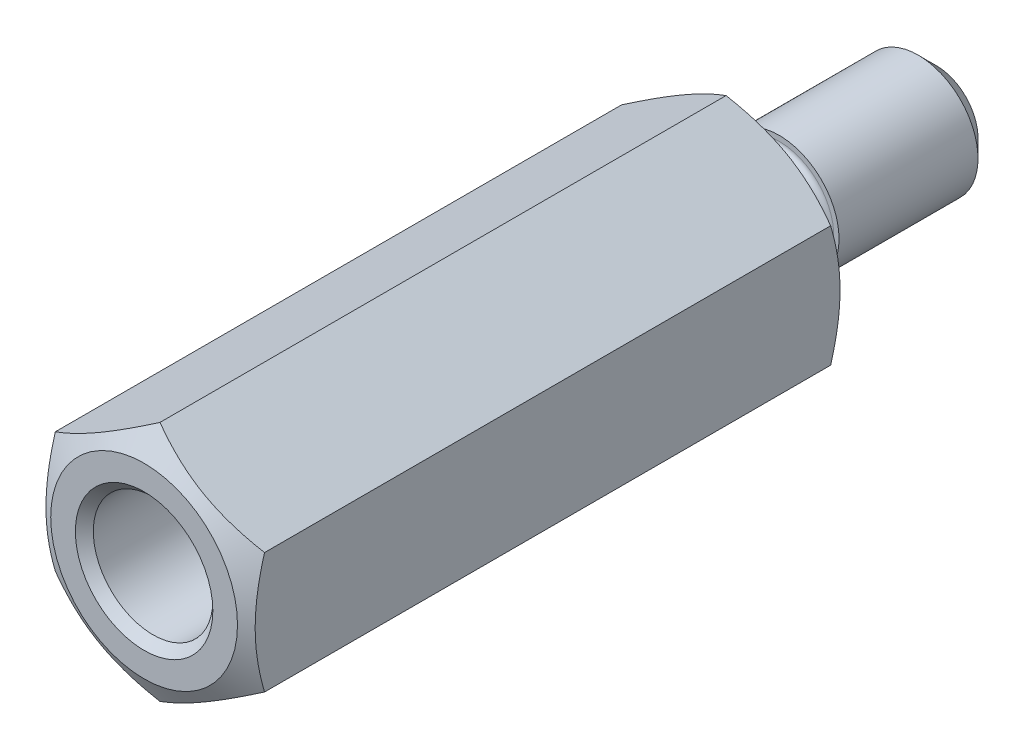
ISO-10303-21;
HEADER;
FILE_DESCRIPTION(('STEP AP214'),'2;1');
FILE_NAME('part.step','',(''),(''),'','','');
FILE_SCHEMA(('AUTOMOTIVE_DESIGN { 1 0 10303 214 1 1 1 1 }'));
ENDSEC;
DATA;
#1=APPLICATION_CONTEXT('core data for automotive mechanical design processes');
#2=APPLICATION_PROTOCOL_DEFINITION('international standard','automotive_design',2000,#1);
#3=PRODUCT_CONTEXT('',#1,'mechanical');
#4=PRODUCT('Part','Part','',(#3));
#5=PRODUCT_RELATED_PRODUCT_CATEGORY('part','',(#4));
#6=PRODUCT_DEFINITION_FORMATION('','',#4);
#7=PRODUCT_DEFINITION_CONTEXT('part definition',#1,'design');
#8=PRODUCT_DEFINITION('design','',#6,#7);
#9=PRODUCT_DEFINITION_SHAPE('','',#8);
#10=(LENGTH_UNIT() NAMED_UNIT(*) SI_UNIT(.MILLI.,.METRE.));
#11=(NAMED_UNIT(*) PLANE_ANGLE_UNIT() SI_UNIT($,.RADIAN.));
#12=(NAMED_UNIT(*) SI_UNIT($,.STERADIAN.) SOLID_ANGLE_UNIT());
#13=UNCERTAINTY_MEASURE_WITH_UNIT(LENGTH_MEASURE(1.E-05),#10,'distance_accuracy_value','');
#14=(GEOMETRIC_REPRESENTATION_CONTEXT(3) GLOBAL_UNCERTAINTY_ASSIGNED_CONTEXT((#13)) GLOBAL_UNIT_ASSIGNED_CONTEXT((#10,
#11,#12)) REPRESENTATION_CONTEXT('',''));
#15=CARTESIAN_POINT('',(0.,0.,0.));
#16=DIRECTION('',(0.,0.,1.));
#17=DIRECTION('',(1.,0.,0.));
#18=AXIS2_PLACEMENT_3D('',#15,#16,#17);
#19=CARTESIAN_POINT('',(0.,-8.08290376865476,0.));
#20=DIRECTION('',(0.,0.,-1.));
#21=DIRECTION('',(-1.,0.,0.));
#22=AXIS2_PLACEMENT_3D('',#19,#20,#21);
#23=PLANE('',#22);
#24=CARTESIAN_POINT('',(0.,0.,0.));
#25=DIRECTION('',(0.,0.,-1.));
#26=DIRECTION('',(-1.,0.,0.));
#27=AXIS2_PLACEMENT_3D('',#24,#25,#26);
#28=CIRCLE('',#27,3.65);
#29=CARTESIAN_POINT('',(-3.65,0.,0.));
#30=VERTEX_POINT('',#29);
#31=EDGE_CURVE('E23',#30,#30,#28,.F.);
#32=ORIENTED_EDGE('',*,*,#31,.T.);
#33=EDGE_LOOP('',(#32));
#34=FACE_BOUND('',#33,.T.);
#35=CARTESIAN_POINT('',(0.,0.,0.));
#36=DIRECTION('',(0.,0.,-1.));
#37=DIRECTION('',(-1.,0.,0.));
#38=AXIS2_PLACEMENT_3D('',#35,#36,#37);
#39=CIRCLE('',#38,6.25);
#40=CARTESIAN_POINT('',(-6.25,0.,0.));
#41=VERTEX_POINT('',#40);
#42=EDGE_CURVE('E73',#41,#41,#39,.T.);
#43=ORIENTED_EDGE('',*,*,#42,.T.);
#44=EDGE_LOOP('',(#43));
#45=FACE_BOUND('',#44,.T.);
#46=ADVANCED_FACE('F14',(#34,#45),#23,.T.);
#47=CARTESIAN_POINT('',(0.,0.,-13.));
#48=DIRECTION('',(0.,0.,1.));
#49=DIRECTION('',(1.,0.,0.));
#50=AXIS2_PLACEMENT_3D('',#47,#48,#49);
#51=CYLINDRICAL_SURFACE('',#50,4.);
#52=CARTESIAN_POINT('',(0.,0.,-2.5));
#53=DIRECTION('',(0.,0.,-1.));
#54=DIRECTION('',(-1.,0.,0.));
#55=AXIS2_PLACEMENT_3D('',#52,#53,#54);
#56=CIRCLE('',#55,4.);
#57=CARTESIAN_POINT('',(-4.,0.,-2.5));
#58=VERTEX_POINT('',#57);
#59=EDGE_CURVE('E233',#58,#58,#56,.T.);
#60=ORIENTED_EDGE('',*,*,#59,.T.);
#61=EDGE_LOOP('',(#60));
#62=FACE_BOUND('',#61,.T.);
#63=CARTESIAN_POINT('',(0.,0.,-11.8));
#64=DIRECTION('',(0.,0.,-1.));
#65=DIRECTION('',(-1.,0.,0.));
#66=AXIS2_PLACEMENT_3D('',#63,#64,#65);
#67=CIRCLE('',#66,4.);
#68=CARTESIAN_POINT('',(-4.,0.,-11.8));
#69=VERTEX_POINT('',#68);
#70=EDGE_CURVE('E85',#69,#69,#67,.F.);
#71=ORIENTED_EDGE('',*,*,#70,.T.);
#72=EDGE_LOOP('',(#71));
#73=FACE_BOUND('',#72,.T.);
#74=ADVANCED_FACE('F209',(#62,#73),#51,.T.);
#75=CARTESIAN_POINT('',(0.,0.,-13.));
#76=DIRECTION('',(0.,0.,-1.));
#77=DIRECTION('',(-1.,0.,0.));
#78=AXIS2_PLACEMENT_3D('',#75,#76,#77);
#79=PLANE('',#78);
#80=CARTESIAN_POINT('',(0.,0.,-13.));
#81=DIRECTION('',(0.,0.,-1.));
#82=DIRECTION('',(-1.,0.,0.));
#83=AXIS2_PLACEMENT_3D('',#80,#81,#82);
#84=CIRCLE('',#83,2.8);
#85=CARTESIAN_POINT('',(-2.8,0.,-13.));
#86=VERTEX_POINT('',#85);
#87=EDGE_CURVE('E82',#86,#86,#84,.T.);
#88=ORIENTED_EDGE('',*,*,#87,.T.);
#89=EDGE_LOOP('',(#88));
#90=FACE_BOUND('',#89,.T.);
#91=ADVANCED_FACE('F213',(#90),#79,.T.);
#92=CARTESIAN_POINT('',(0.,0.,-13.));
#93=DIRECTION('',(0.,0.,1.));
#94=DIRECTION('',(1.,0.,0.));
#95=AXIS2_PLACEMENT_3D('',#92,#93,#94);
#96=CONICAL_SURFACE('',#95,2.8,0.785398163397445);
#97=ORIENTED_EDGE('',*,*,#70,.F.);
#98=EDGE_LOOP('',(#97));
#99=FACE_BOUND('',#98,.T.);
#100=ORIENTED_EDGE('',*,*,#87,.F.);
#101=EDGE_LOOP('',(#100));
#102=FACE_BOUND('',#101,.T.);
#103=ADVANCED_FACE('F216',(#99,#102),#96,.T.);
#104=CARTESIAN_POINT('',(0.,0.,-2.5));
#105=DIRECTION('',(0.,0.,-1.));
#106=DIRECTION('',(-1.,0.,0.));
#107=AXIS2_PLACEMENT_3D('',#104,#105,#106);
#108=PLANE('',#107);
#109=CARTESIAN_POINT('',(0.,0.,-2.5));
#110=DIRECTION('',(0.,0.,-1.));
#111=DIRECTION('',(-1.,0.,0.));
#112=AXIS2_PLACEMENT_3D('',#109,#110,#111);
#113=CIRCLE('',#112,3.65);
#114=CARTESIAN_POINT('',(-3.65,0.,-2.5));
#115=VERTEX_POINT('',#114);
#116=EDGE_CURVE('E93',#115,#115,#113,.T.);
#117=ORIENTED_EDGE('',*,*,#116,.T.);
#118=EDGE_LOOP('',(#117));
#119=FACE_BOUND('',#118,.T.);
#120=ORIENTED_EDGE('',*,*,#59,.F.);
#121=EDGE_LOOP('',(#120));
#122=FACE_BOUND('',#121,.T.);
#123=ADVANCED_FACE('F218',(#119,#122),#108,.F.);
#124=CARTESIAN_POINT('',(0.,0.,-2.5));
#125=DIRECTION('',(0.,0.,1.));
#126=DIRECTION('',(1.,0.,0.));
#127=AXIS2_PLACEMENT_3D('',#124,#125,#126);
#128=CYLINDRICAL_SURFACE('',#127,3.25);
#129=CARTESIAN_POINT('',(0.,0.,-2.1));
#130=DIRECTION('',(0.,0.,-1.));
#131=DIRECTION('',(-1.,0.,0.));
#132=AXIS2_PLACEMENT_3D('',#129,#130,#131);
#133=CIRCLE('',#132,3.25);
#134=CARTESIAN_POINT('',(-3.25,0.,-2.1));
#135=VERTEX_POINT('',#134);
#136=EDGE_CURVE('E99',#135,#135,#133,.F.);
#137=ORIENTED_EDGE('',*,*,#136,.T.);
#138=EDGE_LOOP('',(#137));
#139=FACE_BOUND('',#138,.T.);
#140=CARTESIAN_POINT('',(0.,0.,-0.4));
#141=DIRECTION('',(0.,0.,-1.));
#142=DIRECTION('',(-1.,0.,0.));
#143=AXIS2_PLACEMENT_3D('',#140,#141,#142);
#144=CIRCLE('',#143,3.25);
#145=CARTESIAN_POINT('',(-3.25,0.,-0.4));
#146=VERTEX_POINT('',#145);
#147=EDGE_CURVE('E96',#146,#146,#144,.T.);
#148=ORIENTED_EDGE('',*,*,#147,.T.);
#149=EDGE_LOOP('',(#148));
#150=FACE_BOUND('',#149,.T.);
#151=ADVANCED_FACE('F121',(#139,#150),#128,.T.);
#152=CARTESIAN_POINT('',(0.,0.,-2.1));
#153=DIRECTION('',(0.,0.,-1.));
#154=DIRECTION('',(-1.,0.,0.));
#155=AXIS2_PLACEMENT_3D('',#152,#153,#154);
#156=TOROIDAL_SURFACE('',#155,3.65,0.4);
#157=ORIENTED_EDGE('',*,*,#136,.F.);
#158=EDGE_LOOP('',(#157));
#159=FACE_BOUND('',#158,.T.);
#160=ORIENTED_EDGE('',*,*,#116,.F.);
#161=EDGE_LOOP('',(#160));
#162=FACE_BOUND('',#161,.T.);
#163=ADVANCED_FACE('F226',(#159,#162),#156,.F.);
#164=CARTESIAN_POINT('',(0.,0.,-0.4));
#165=DIRECTION('',(0.,0.,-1.));
#166=DIRECTION('',(-1.,0.,0.));
#167=AXIS2_PLACEMENT_3D('',#164,#165,#166);
#168=TOROIDAL_SURFACE('',#167,3.65,0.4);
#169=ORIENTED_EDGE('',*,*,#31,.F.);
#170=EDGE_LOOP('',(#169));
#171=FACE_BOUND('',#170,.T.);
#172=ORIENTED_EDGE('',*,*,#147,.F.);
#173=EDGE_LOOP('',(#172));
#174=FACE_BOUND('',#173,.T.);
#175=ADVANCED_FACE('F16',(#171,#174),#168,.F.);
#176=CARTESIAN_POINT('',(0.,0.,0.));
#177=DIRECTION('',(0.,0.,1.));
#178=DIRECTION('',(-1.,0.,0.));
#179=AXIS2_PLACEMENT_3D('',#176,#177,#178);
#180=CONICAL_SURFACE('',#179,6.25,1.0471975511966);
#181=ORIENTED_EDGE('',*,*,#42,.F.);
#182=EDGE_LOOP('',(#181));
#183=FACE_BOUND('',#182,.T.);
#184=CARTESIAN_POINT('',(7.,-40.0788695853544,19.8813868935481));
#185=CARTESIAN_POINT('',(6.99999999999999,-39.4564520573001,19.527394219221));
#186=CARTESIAN_POINT('',(6.99999999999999,-38.8339311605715,19.1735833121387));
#187=CARTESIAN_POINT('',(6.99999999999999,-37.588646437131,18.4663860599));
#188=CARTESIAN_POINT('',(6.99999999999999,-36.9658826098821,18.1129997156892));
#189=CARTESIAN_POINT('',(6.99999999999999,-35.0958120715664,17.0527978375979));
#190=CARTESIAN_POINT('',(6.99999999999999,-33.8480896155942,16.3467151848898));
#191=CARTESIAN_POINT('',(6.99999999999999,-31.323923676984,14.9218637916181));
#192=CARTESIAN_POINT('',(6.99999999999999,-30.0474469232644,14.2031539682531));
#193=CARTESIAN_POINT('',(6.99999999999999,-27.4936585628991,12.7705064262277));
#194=CARTESIAN_POINT('',(6.99999999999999,-26.2163494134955,12.0565643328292));
#195=CARTESIAN_POINT('',(6.99999999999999,-24.0519258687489,10.8534439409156));
#196=CARTESIAN_POINT('',(6.99999999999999,-23.1656820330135,10.3627006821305));
#197=CARTESIAN_POINT('',(6.99999999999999,-21.3910012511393,9.38520060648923));
#198=CARTESIAN_POINT('',(6.99999999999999,-20.5025643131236,8.89844377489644));
#199=CARTESIAN_POINT('',(6.99999999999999,-18.719141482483,7.92868056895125));
#200=CARTESIAN_POINT('',(7.,-17.8241435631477,7.4456962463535));
#201=CARTESIAN_POINT('',(7.,-16.4783843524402,6.72771327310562));
#202=CARTESIAN_POINT('',(7.,-16.0293337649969,6.48950933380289));
#203=CARTESIAN_POINT('',(7.,-15.1298181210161,6.01578887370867));
#204=CARTESIAN_POINT('',(7.,-14.6793530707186,5.78027234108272));
#205=CARTESIAN_POINT('',(7.,-13.7842445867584,5.31656346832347));
#206=CARTESIAN_POINT('',(7.,-13.3396305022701,5.08831455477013));
#207=CARTESIAN_POINT('',(7.,-12.4482504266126,4.63602705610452));
#208=CARTESIAN_POINT('',(7.,-12.0014843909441,4.41198855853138));
#209=CARTESIAN_POINT('',(7.,-11.104560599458,3.9690957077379));
#210=CARTESIAN_POINT('',(7.,-10.6543988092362,3.75024949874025));
#211=CARTESIAN_POINT('',(7.,-9.75057208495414,3.31996231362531));
#212=CARTESIAN_POINT('',(7.,-9.29690735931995,3.10852090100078));
#213=CARTESIAN_POINT('',(7.,-8.38826181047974,2.69721194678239));
#214=CARTESIAN_POINT('',(7.,-7.93331411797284,2.49727188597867));
#215=CARTESIAN_POINT('',(7.,-7.24639535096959,2.20780039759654));
#216=CARTESIAN_POINT('',(7.,-7.01663130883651,2.11303362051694));
#217=CARTESIAN_POINT('',(7.,-6.55542379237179,1.92768810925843));
#218=CARTESIAN_POINT('',(7.,-6.32398036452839,1.8371092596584));
#219=CARTESIAN_POINT('',(7.,-5.85978589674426,1.66117546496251));
#220=CARTESIAN_POINT('',(7.,-5.62703978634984,1.57580761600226));
#221=CARTESIAN_POINT('',(7.,-5.15945027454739,1.41104483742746));
#222=CARTESIAN_POINT('',(7.,-4.92460676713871,1.33165021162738));
#223=CARTESIAN_POINT('',(7.,-4.21690794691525,1.1042544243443));
#224=CARTESIAN_POINT('',(7.,-3.74045142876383,0.966872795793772));
#225=CARTESIAN_POINT('',(7.,-3.17322114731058,0.828650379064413));
#226=CARTESIAN_POINT('',(7.,-3.08709217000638,0.808341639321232));
#227=CARTESIAN_POINT('',(7.,-2.91451401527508,0.769082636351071));
#228=CARTESIAN_POINT('',(7.,-2.82806480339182,0.750132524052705));
#229=CARTESIAN_POINT('',(7.,-2.56821488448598,0.695424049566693));
#230=CARTESIAN_POINT('',(7.,-2.394354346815,0.661817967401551));
#231=CARTESIAN_POINT('',(7.,-2.04561047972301,0.600951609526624));
#232=CARTESIAN_POINT('',(7.,-1.8707276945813,0.573688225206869));
#233=CARTESIAN_POINT('',(7.,-1.52002976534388,0.526027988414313));
#234=CARTESIAN_POINT('',(7.,-1.34421466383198,0.505630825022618));
#235=CARTESIAN_POINT('',(7.,-0.995770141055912,0.472520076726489));
#236=CARTESIAN_POINT('',(7.,-0.823155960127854,0.459646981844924));
#237=CARTESIAN_POINT('',(7.,-0.477539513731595,0.441187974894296));
#238=CARTESIAN_POINT('',(7.,-0.304537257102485,0.435601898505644));
#239=CARTESIAN_POINT('',(7.,0.0416431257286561,0.431848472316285));
#240=CARTESIAN_POINT('',(7.,0.214821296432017,0.433685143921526));
#241=CARTESIAN_POINT('',(7.,0.560944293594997,0.444739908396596));
#242=CARTESIAN_POINT('',(7.,0.733889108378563,0.453958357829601));
#243=CARTESIAN_POINT('',(7.,1.14493049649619,0.484442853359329));
#244=CARTESIAN_POINT('',(7.,1.3827917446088,0.508957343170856));
#245=CARTESIAN_POINT('',(7.,1.85685150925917,0.570655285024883));
#246=CARTESIAN_POINT('',(7.,2.09304982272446,0.607840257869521));
#247=CARTESIAN_POINT('',(7.,2.7986526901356,0.736413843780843));
#248=CARTESIAN_POINT('',(7.,3.26500374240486,0.844815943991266));
#249=CARTESIAN_POINT('',(7.,3.96373412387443,1.03437819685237));
#250=CARTESIAN_POINT('',(7.,4.1996747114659,1.10317424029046));
#251=CARTESIAN_POINT('',(7.,4.66926180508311,1.24826377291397));
#252=CARTESIAN_POINT('',(7.,4.90290828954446,1.32455733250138));
#253=CARTESIAN_POINT('',(7.,5.36802100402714,1.48339993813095));
#254=CARTESIAN_POINT('',(7.,5.59948744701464,1.56594836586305));
#255=CARTESIAN_POINT('',(7.,5.94522438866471,1.69369458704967));
#256=CARTESIAN_POINT('',(7.,6.0602245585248,1.73692992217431));
#257=CARTESIAN_POINT('',(7.,6.28976630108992,1.82460028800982));
#258=CARTESIAN_POINT('',(7.,6.40430787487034,1.86903531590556));
#259=CARTESIAN_POINT('',(7.,6.7870502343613,2.01962779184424));
#260=CARTESIAN_POINT('',(7.,7.05428107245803,2.12825574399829));
#261=CARTESIAN_POINT('',(7.,7.58669792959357,2.35042439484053));
#262=CARTESIAN_POINT('',(7.,7.85188384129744,2.46396534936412));
#263=CARTESIAN_POINT('',(7.,8.38053780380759,2.69509412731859));
#264=CARTESIAN_POINT('',(7.,8.64400554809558,2.81268265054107));
#265=CARTESIAN_POINT('',(7.,9.16942946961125,3.05119415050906));
#266=CARTESIAN_POINT('',(7.,9.43138561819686,3.17211719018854));
#267=CARTESIAN_POINT('',(7.,10.2156740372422,3.53919001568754));
#268=CARTESIAN_POINT('',(7.,10.7360662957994,3.78948419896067));
#269=CARTESIAN_POINT('',(7.,11.7729572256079,4.29784317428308));
#270=CARTESIAN_POINT('',(7.,12.2894562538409,4.55590724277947));
#271=CARTESIAN_POINT('',(7.,13.3207676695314,5.07836241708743));
#272=CARTESIAN_POINT('',(7.,13.8355732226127,5.34276698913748));
#273=CARTESIAN_POINT('',(7.,14.8629595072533,5.87587996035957));
#274=CARTESIAN_POINT('',(7.,15.3755401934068,6.14458844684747));
#275=CARTESIAN_POINT('',(7.,16.3987481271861,6.68519041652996));
#276=CARTESIAN_POINT('',(7.,16.9093760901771,6.95708254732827));
#277=CARTESIAN_POINT('',(7.,17.9292508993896,7.50344614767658));
#278=CARTESIAN_POINT('',(7.,18.4384977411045,7.77791762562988));
#279=CARTESIAN_POINT('',(7.,19.8116569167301,8.52157262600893));
#280=CARTESIAN_POINT('',(7.,20.6745263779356,8.99268112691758));
#281=CARTESIAN_POINT('',(7.,22.3981062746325,9.93906496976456));
#282=CARTESIAN_POINT('',(7.,23.2588164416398,10.414340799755));
#283=CARTESIAN_POINT('',(7.,24.9748594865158,11.3658352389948));
#284=CARTESIAN_POINT('',(7.,25.8301995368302,11.8420409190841));
#285=CARTESIAN_POINT('',(7.00000000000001,27.1122177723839,12.5579939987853));
#286=CARTESIAN_POINT('',(7.00000000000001,27.5393642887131,12.7969036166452));
#287=CARTESIAN_POINT('',(7.,28.3933811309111,13.2752152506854));
#288=CARTESIAN_POINT('',(7.,28.8202514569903,13.5146172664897));
#289=CARTESIAN_POINT('',(7.,29.2470019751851,13.7542326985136));
#290=B_SPLINE_CURVE_WITH_KNOTS('',3,(#184,#185,#186,#187,#188,#189,#190,#191,#192,#193,#194,
#195,#196,#197,#198,#199,#200,#201,#202,#203,#204,#205,#206,#207,#208,#209,#210,#211,#212,#213,
#214,#215,#216,#217,#218,#219,#220,#221,#222,#223,#224,#225,#226,#227,#228,#229,#230,#231,#232,
#233,#234,#235,#236,#237,#238,#239,#240,#241,#242,#243,#244,#245,#246,#247,#248,#249,#250,#251,
#252,#253,#254,#255,#256,#257,#258,#259,#260,#261,#262,#263,#264,#265,#266,#267,#268,#269,#270,
#271,#272,#273,#274,#275,#276,#277,#278,#279,#280,#281,#282,#283,#284,#285,#286,#287,#288,#289),
.UNSPECIFIED.,.F.,.F.,(4,2,2,2,2,2,2,2,2,2,2,2,2,2,2,2,2,2,2,2,2,2,2,2,2,2,2,2,2,2,2,2,2,2,2,2,
2,2,2,2,2,2,2,2,2,2,2,2,2,2,2,2,4),(0.,2.14812225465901,4.29624928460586,8.59720901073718,
12.9919095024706,17.3817826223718,20.4209055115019,23.4600171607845,26.510989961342,
28.0359381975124,29.5608797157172,31.0602000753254,32.5595515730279,34.0611172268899,
35.5625942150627,37.0532344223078,37.7988218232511,38.5443886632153,39.2880273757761,
40.0317038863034,41.5176646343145,41.7831307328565,42.0486262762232,42.5797484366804,
43.1106097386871,43.6414469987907,44.1605789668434,44.6796992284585,45.1991007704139,
45.7185274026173,46.4354908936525,47.1525404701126,48.5868237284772,49.3240535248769,
50.0612902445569,50.7984541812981,51.1670252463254,51.5355954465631,52.4009237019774,
53.2662970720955,54.1318208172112,54.9973609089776,56.7296218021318,58.4617218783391,
60.1979001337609,61.9341136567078,63.669614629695,65.4051212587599,68.3544050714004,
71.3040390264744,74.2409384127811,75.7091982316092,77.1774569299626),.UNSPECIFIED.);
#291=CARTESIAN_POINT('',(7.,4.04145188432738,1.0582274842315));
#292=VERTEX_POINT('',#291);
#293=CARTESIAN_POINT('',(7.,-4.04145188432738,1.0582274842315));
#294=VERTEX_POINT('',#293);
#295=EDGE_CURVE('E30',#292,#294,#290,.F.);
#296=ORIENTED_EDGE('',*,*,#295,.T.);
#297=CARTESIAN_POINT('',(7.0002,-4.04133641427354,1.0582941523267));
#298=CARTESIAN_POINT('',(6.84633209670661,-4.13017208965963,1.0070125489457));
#299=CARTESIAN_POINT('',(6.69189049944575,-4.21933898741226,0.958058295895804));
#300=CARTESIAN_POINT('',(6.38175307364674,-4.39839691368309,0.865445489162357));
#301=CARTESIAN_POINT('',(6.22605673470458,-4.48828823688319,0.821789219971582));
#302=CARTESIAN_POINT('',(5.75647483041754,-4.75940147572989,0.699624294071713));
#303=CARTESIAN_POINT('',(5.4407356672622,-4.94169356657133,0.63013825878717));
#304=CARTESIAN_POINT('',(4.96823775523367,-5.21449036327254,0.548657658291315));
#305=CARTESIAN_POINT('',(4.81289077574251,-5.30417998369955,0.525446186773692));
#306=CARTESIAN_POINT('',(4.50149488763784,-5.48396448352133,0.486523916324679));
#307=CARTESIAN_POINT('',(4.34544604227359,-5.57405932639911,0.470812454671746));
#308=CARTESIAN_POINT('',(4.03307732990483,-5.75440548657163,0.447290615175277));
#309=CARTESIAN_POINT('',(3.87675797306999,-5.84465650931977,0.439471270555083));
#310=CARTESIAN_POINT('',(3.56398349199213,-6.02523694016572,0.431892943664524));
#311=CARTESIAN_POINT('',(3.40752837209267,-6.11556634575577,0.432133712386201));
#312=CARTESIAN_POINT('',(2.97889312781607,-6.36303901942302,0.443872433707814));
#313=CARTESIAN_POINT('',(2.70685331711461,-6.52010127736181,0.463578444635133));
#314=CARTESIAN_POINT('',(2.16458055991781,-6.83318259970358,0.526066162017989));
#315=CARTESIAN_POINT('',(1.89434952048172,-6.9892005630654,0.568869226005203));
#316=CARTESIAN_POINT('',(1.35098545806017,-7.30291195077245,0.675864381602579));
#317=CARTESIAN_POINT('',(1.07792099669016,-7.46056579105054,0.740509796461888));
#318=CARTESIAN_POINT('',(0.535864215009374,-7.77352241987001,0.887228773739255));
#319=CARTESIAN_POINT('',(0.266864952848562,-7.92882921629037,0.969267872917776));
#320=CARTESIAN_POINT('',(-0.00019999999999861,-8.0830192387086,1.0582941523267));
#321=B_SPLINE_CURVE_WITH_KNOTS('',3,(#297,#298,#299,#300,#301,#302,#303,#304,#305,#306,#307,
#308,#309,#310,#311,#312,#313,#314,#315,#316,#317,#318,#319,#320),.UNSPECIFIED.,.F.,.F.,(4,2,2,
2,2,2,2,2,2,2,2,4),(0.,0.554727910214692,1.10969417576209,2.22193274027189,2.76443041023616,
3.30688013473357,3.84871284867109,4.39052882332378,5.33376515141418,6.27787517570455,
7.24292418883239,8.20607866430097),.UNSPECIFIED.);
#322=CARTESIAN_POINT('',(0.,-8.08290376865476,1.0582274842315));
#323=VERTEX_POINT('',#322);
#324=EDGE_CURVE('E67',#294,#323,#321,.T.);
#325=ORIENTED_EDGE('',*,*,#324,.T.);
#326=CARTESIAN_POINT('',(0.000200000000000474,-8.0830192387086,1.0582941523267));
#327=CARTESIAN_POINT('',(-0.153667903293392,-7.99418356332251,1.0070125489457));
#328=CARTESIAN_POINT('',(-0.308109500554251,-7.90501666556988,0.958058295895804));
#329=CARTESIAN_POINT('',(-0.618246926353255,-7.72595873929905,0.865445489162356));
#330=CARTESIAN_POINT('',(-0.773943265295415,-7.63606741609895,0.821789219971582));
#331=CARTESIAN_POINT('',(-1.24352516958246,-7.36495417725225,0.699624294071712));
#332=CARTESIAN_POINT('',(-1.5592643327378,-7.18266208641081,0.63013825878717));
#333=CARTESIAN_POINT('',(-2.03176224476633,-6.9098652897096,0.548657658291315));
#334=CARTESIAN_POINT('',(-2.18710922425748,-6.82017566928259,0.525446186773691));
#335=CARTESIAN_POINT('',(-2.49850511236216,-6.64039116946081,0.486523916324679));
#336=CARTESIAN_POINT('',(-2.65455395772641,-6.55029632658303,0.470812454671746));
#337=CARTESIAN_POINT('',(-2.96692267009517,-6.36995016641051,0.447290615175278));
#338=CARTESIAN_POINT('',(-3.12324202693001,-6.27969914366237,0.439471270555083));
#339=CARTESIAN_POINT('',(-3.43601650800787,-6.09911871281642,0.431892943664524));
#340=CARTESIAN_POINT('',(-3.59247162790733,-6.00878930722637,0.432133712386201));
#341=CARTESIAN_POINT('',(-4.02110687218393,-5.76131663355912,0.443872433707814));
#342=CARTESIAN_POINT('',(-4.29314668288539,-5.60425437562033,0.463578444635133));
#343=CARTESIAN_POINT('',(-4.83541944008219,-5.29117305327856,0.526066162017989));
#344=CARTESIAN_POINT('',(-5.10565047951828,-5.13515508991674,0.568869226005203));
#345=CARTESIAN_POINT('',(-5.64901454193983,-4.82144370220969,0.67586438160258));
#346=CARTESIAN_POINT('',(-5.92207900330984,-4.66378986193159,0.740509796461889));
#347=CARTESIAN_POINT('',(-6.46413578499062,-4.35083323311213,0.887228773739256));
#348=CARTESIAN_POINT('',(-6.73313504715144,-4.19552643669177,0.969267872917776));
#349=CARTESIAN_POINT('',(-7.0002,-4.04133641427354,1.0582941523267));
#350=B_SPLINE_CURVE_WITH_KNOTS('',3,(#326,#327,#328,#329,#330,#331,#332,#333,#334,#335,#336,
#337,#338,#339,#340,#341,#342,#343,#344,#345,#346,#347,#348,#349),.UNSPECIFIED.,.F.,.F.,(4,2,2,
2,2,2,2,2,2,2,2,4),(0.,0.554727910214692,1.10969417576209,2.22193274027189,2.76443041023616,
3.30688013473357,3.84871284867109,4.39052882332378,5.33376515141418,6.27787517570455,
7.24292418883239,8.20607866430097),.UNSPECIFIED.);
#351=CARTESIAN_POINT('',(-7.,-4.04145188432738,1.0582274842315));
#352=VERTEX_POINT('',#351);
#353=EDGE_CURVE('E69',#323,#352,#350,.T.);
#354=ORIENTED_EDGE('',*,*,#353,.T.);
#355=CARTESIAN_POINT('',(-7.,-40.0788696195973,19.8813869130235));
#356=CARTESIAN_POINT('',(-7.00000000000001,-39.4564520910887,19.527394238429));
#357=CARTESIAN_POINT('',(-7.00000000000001,-38.8339311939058,19.1735833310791));
#358=CARTESIAN_POINT('',(-7.00000000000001,-37.588646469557,18.4663860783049));
#359=CARTESIAN_POINT('',(-7.00000000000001,-36.9658826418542,18.1129997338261));
#360=CARTESIAN_POINT('',(-7.00000000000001,-35.0958121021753,17.052797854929));
#361=CARTESIAN_POINT('',(-7.00000000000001,-33.8480896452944,16.3467152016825));
#362=CARTESIAN_POINT('',(-7.00000000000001,-31.3239237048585,14.9218638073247));
#363=CARTESIAN_POINT('',(-7.00000000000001,-30.0474469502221,14.2031539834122));
#364=CARTESIAN_POINT('',(-7.00000000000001,-27.493658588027,12.7705064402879));
#365=CARTESIAN_POINT('',(-7.00000000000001,-26.2163494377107,12.0565643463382));
#366=CARTESIAN_POINT('',(-7.00000000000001,-24.0519258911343,10.8534439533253));
#367=CARTESIAN_POINT('',(-7.00000000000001,-23.1656820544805,10.362700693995));
#368=CARTESIAN_POINT('',(-7.00000000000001,-21.3910012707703,9.38520061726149));
#369=CARTESIAN_POINT('',(-7.00000000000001,-20.5025643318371,8.89844378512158));
#370=CARTESIAN_POINT('',(-7.00000000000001,-18.7191414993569,7.9286805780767));
#371=CARTESIAN_POINT('',(-7.00000000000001,-17.8241435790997,7.4456962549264));
#372=CARTESIAN_POINT('',(-7.,-16.4783843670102,6.72771328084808));
#373=CARTESIAN_POINT('',(-7.,-16.0293337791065,6.48950934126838));
#374=CARTESIAN_POINT('',(-7.,-15.1298181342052,6.01578888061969));
#375=CARTESIAN_POINT('',(-7.,-14.6793530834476,5.78027234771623));
#376=CARTESIAN_POINT('',(-7.,-13.7842445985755,5.31656347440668));
#377=CARTESIAN_POINT('',(-7.,-13.3396305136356,5.08831456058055));
#378=CARTESIAN_POINT('',(-7.,-12.4482504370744,4.63602706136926));
#379=CARTESIAN_POINT('',(-7.,-12.0014844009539,4.41198856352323));
#380=CARTESIAN_POINT('',(-7.,-11.1045606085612,3.96909571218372));
#381=CARTESIAN_POINT('',(-7.,-10.6543988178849,3.75024950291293));
#382=CARTESIAN_POINT('',(-7.,-9.75057209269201,3.31996231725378));
#383=CARTESIAN_POINT('',(-7.,-9.29690736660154,3.10852090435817));
#384=CARTESIAN_POINT('',(-7.,-8.38826181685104,2.69721194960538));
#385=CARTESIAN_POINT('',(-7.,-7.93331412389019,2.49727188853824));
#386=CARTESIAN_POINT('',(-7.,-7.2463953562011,2.20780039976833));
#387=CARTESIAN_POINT('',(-7.,-7.01663131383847,2.11303362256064));
#388=CARTESIAN_POINT('',(-7.,-6.55542379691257,1.92768811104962));
#389=CARTESIAN_POINT('',(-7.,-6.32398036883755,1.83710926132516));
#390=CARTESIAN_POINT('',(-7.,-5.85978590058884,1.66117546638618));
#391=CARTESIAN_POINT('',(-7.,-5.62703978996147,1.57580761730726));
#392=CARTESIAN_POINT('',(-7.,-5.15945027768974,1.41104483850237));
#393=CARTESIAN_POINT('',(-7.,-4.92460677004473,1.3316502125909));
#394=CARTESIAN_POINT('',(-7.,-4.21690794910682,1.10425442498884));
#395=CARTESIAN_POINT('',(-7.,-3.74045143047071,0.966872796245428));
#396=CARTESIAN_POINT('',(-7.,-3.17322114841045,0.828650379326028));
#397=CARTESIAN_POINT('',(-7.,-3.08709217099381,0.808341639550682));
#398=CARTESIAN_POINT('',(-7.,-2.91451401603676,0.76908263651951));
#399=CARTESIAN_POINT('',(-7.,-2.8280648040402,0.750132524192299));
#400=CARTESIAN_POINT('',(-7.,-2.56821488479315,0.695424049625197));
#401=CARTESIAN_POINT('',(-7.,-2.39435434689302,0.661817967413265));
#402=CARTESIAN_POINT('',(-7.,-2.04561047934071,0.600951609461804));
#403=CARTESIAN_POINT('',(-7.,-1.87072769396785,0.573688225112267));
#404=CARTESIAN_POINT('',(-7.,-1.52002976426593,0.526027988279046));
#405=CARTESIAN_POINT('',(-7.,-1.34421466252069,0.505630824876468));
#406=CARTESIAN_POINT('',(-7.,-0.99577013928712,0.472520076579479));
#407=CARTESIAN_POINT('',(-7.,-0.823155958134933,0.459646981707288));
#408=CARTESIAN_POINT('',(-7.,-0.477539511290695,0.441187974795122));
#409=CARTESIAN_POINT('',(-7.,-0.304537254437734,0.435601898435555));
#410=CARTESIAN_POINT('',(-7.,0.0416431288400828,0.431848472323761));
#411=CARTESIAN_POINT('',(-7.,0.21482129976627,0.43368514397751));
#412=CARTESIAN_POINT('',(-7.,0.560944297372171,0.444739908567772));
#413=CARTESIAN_POINT('',(-7.,0.733889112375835,0.453958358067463));
#414=CARTESIAN_POINT('',(-7.,1.14493050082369,0.48444285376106));
#415=CARTESIAN_POINT('',(-7.,1.38279174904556,0.5089573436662));
#416=CARTESIAN_POINT('',(-7.,1.85685151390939,0.570655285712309));
#417=CARTESIAN_POINT('',(-7.,2.09304982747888,0.607840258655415));
#418=CARTESIAN_POINT('',(-7.,2.79865269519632,0.736413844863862));
#419=CARTESIAN_POINT('',(-7.,3.2650037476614,0.844815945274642));
#420=CARTESIAN_POINT('',(-7.,3.96373412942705,1.03437819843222));
#421=CARTESIAN_POINT('',(-7.,4.19967471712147,1.10317424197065));
#422=CARTESIAN_POINT('',(-7.,4.66926181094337,1.24826377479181));
#423=CARTESIAN_POINT('',(-7.,4.90290829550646,1.32455733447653));
#424=CARTESIAN_POINT('',(-7.,5.36802101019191,1.48339994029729));
#425=CARTESIAN_POINT('',(-7.,5.59948745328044,1.56594836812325));
#426=CARTESIAN_POINT('',(-7.,5.94522439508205,1.69369458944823));
#427=CARTESIAN_POINT('',(-7.,6.06022456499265,1.73692992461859));
#428=CARTESIAN_POINT('',(-7.,6.28976630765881,1.82460029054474));
#429=CARTESIAN_POINT('',(-7.,6.40430788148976,1.86903531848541));
#430=CARTESIAN_POINT('',(-7.,6.78705024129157,2.01962779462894));
#431=CARTESIAN_POINT('',(-7.,7.05428107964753,2.12825574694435));
#432=CARTESIAN_POINT('',(-6.99999999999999,7.58669793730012,2.3504243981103));
#433=CARTESIAN_POINT('',(-7.,7.8518838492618,2.46396535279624));
#434=CARTESIAN_POINT('',(-7.,8.38053781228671,2.69509413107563));
#435=CARTESIAN_POINT('',(-7.,8.64400555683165,2.8126826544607));
#436=CARTESIAN_POINT('',(-7.,9.16942947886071,3.05119415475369));
#437=CARTESIAN_POINT('',(-7.,9.43138562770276,3.17211719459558));
#438=CARTESIAN_POINT('',(-7.,10.2156740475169,3.53919002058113));
#439=CARTESIAN_POINT('',(-6.99999999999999,10.7360663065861,3.78948420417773));
#440=CARTESIAN_POINT('',(-6.99999999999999,11.7729572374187,4.29784318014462));
#441=CARTESIAN_POINT('',(-6.99999999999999,12.2894562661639,4.555907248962));
#442=CARTESIAN_POINT('',(-6.99999999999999,13.3207676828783,5.07836242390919));
#443=CARTESIAN_POINT('',(-6.99999999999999,13.8355732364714,5.34276699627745));
#444=CARTESIAN_POINT('',(-6.99999999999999,14.8629595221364,5.87587996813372));
#445=CARTESIAN_POINT('',(-6.99999999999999,15.3755402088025,6.14458845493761));
#446=CARTESIAN_POINT('',(-6.99999999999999,16.3987481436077,6.68519042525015));
#447=CARTESIAN_POINT('',(-6.99999999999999,16.9093761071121,6.95708255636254));
#448=CARTESIAN_POINT('',(-6.99999999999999,17.9292509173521,7.50344615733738));
#449=CARTESIAN_POINT('',(-6.99999999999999,18.4384977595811,7.77791763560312));
#450=CARTESIAN_POINT('',(-6.99999999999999,19.8116569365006,8.52157263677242));
#451=CARTESIAN_POINT('',(-6.99999999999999,20.6745263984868,8.99268113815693));
#452=CARTESIAN_POINT('',(-6.99999999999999,22.398106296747,9.93906498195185));
#453=CARTESIAN_POINT('',(-6.99999999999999,23.2588164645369,10.4143408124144));
#454=CARTESIAN_POINT('',(-6.99999999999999,24.9748595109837,11.3658352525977));
#455=CARTESIAN_POINT('',(-6.99999999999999,25.8301995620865,11.8420409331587));
#456=CARTESIAN_POINT('',(-6.99999999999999,27.1122177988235,12.5579940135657));
#457=CARTESIAN_POINT('',(-6.99999999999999,27.5393643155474,12.7969036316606));
#458=CARTESIAN_POINT('',(-6.99999999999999,28.3933811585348,13.2752152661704));
#459=CARTESIAN_POINT('',(-6.99999999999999,28.8202514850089,13.5146172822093));
#460=CARTESIAN_POINT('',(-7.,29.2470020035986,13.7542327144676));
#461=B_SPLINE_CURVE_WITH_KNOTS('',3,(#355,#356,#357,#358,#359,#360,#361,#362,#363,#364,#365,
#366,#367,#368,#369,#370,#371,#372,#373,#374,#375,#376,#377,#378,#379,#380,#381,#382,#383,#384,
#385,#386,#387,#388,#389,#390,#391,#392,#393,#394,#395,#396,#397,#398,#399,#400,#401,#402,#403,
#404,#405,#406,#407,#408,#409,#410,#411,#412,#413,#414,#415,#416,#417,#418,#419,#420,#421,#422,
#423,#424,#425,#426,#427,#428,#429,#430,#431,#432,#433,#434,#435,#436,#437,#438,#439,#440,#441,
#442,#443,#444,#445,#446,#447,#448,#449,#450,#451,#452,#453,#454,#455,#456,#457,#458,#459,#460),
.UNSPECIFIED.,.F.,.F.,(4,2,2,2,2,2,2,2,2,2,2,2,2,2,2,2,2,2,2,2,2,2,2,2,2,2,2,2,2,2,2,2,2,2,2,2,
2,2,2,2,2,2,2,2,2,2,2,2,2,2,2,2,4),(0.,2.14812225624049,4.29624928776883,8.59720901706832,
12.9919095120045,17.3817826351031,20.4209055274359,23.4600171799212,26.5109899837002,
28.0359382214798,29.5608797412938,31.0602001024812,32.5595516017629,34.0611172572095,
35.5625942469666,37.0532344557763,37.7988218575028,38.5443886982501,39.2880274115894,
40.0317039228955,41.5176646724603,41.7831307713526,42.0486263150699,42.5797484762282,
43.1106097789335,43.6414470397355,44.160579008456,44.6796992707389,45.1991008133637,
45.7185274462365,46.4354909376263,47.1525405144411,48.5868237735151,49.3240535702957,
50.0612902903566,50.798454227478,51.1670252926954,51.5355954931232,52.4009237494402,
53.2662971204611,54.1318208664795,54.9973609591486,56.7296218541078,58.46172193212,
60.1979001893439,61.9341137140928,63.6696146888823,65.4051213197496,68.35440513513,
71.3040390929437,74.240938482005,75.7091983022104,77.1774570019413),.UNSPECIFIED.);
#462=CARTESIAN_POINT('',(-7.,4.04145188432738,1.0582274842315));
#463=VERTEX_POINT('',#462);
#464=EDGE_CURVE('E78',#352,#463,#461,.T.);
#465=ORIENTED_EDGE('',*,*,#464,.T.);
#466=CARTESIAN_POINT('',(-7.0002,4.04133641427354,1.0582941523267));
#467=CARTESIAN_POINT('',(-6.84633209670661,4.13017208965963,1.0070125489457));
#468=CARTESIAN_POINT('',(-6.69189049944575,4.21933898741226,0.958058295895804));
#469=CARTESIAN_POINT('',(-6.38175307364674,4.39839691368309,0.865445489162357));
#470=CARTESIAN_POINT('',(-6.22605673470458,4.48828823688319,0.821789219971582));
#471=CARTESIAN_POINT('',(-5.75647483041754,4.75940147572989,0.699624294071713));
#472=CARTESIAN_POINT('',(-5.4407356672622,4.94169356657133,0.63013825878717));
#473=CARTESIAN_POINT('',(-4.96823775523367,5.21449036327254,0.548657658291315));
#474=CARTESIAN_POINT('',(-4.81289077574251,5.30417998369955,0.525446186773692));
#475=CARTESIAN_POINT('',(-4.50149488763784,5.48396448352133,0.486523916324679));
#476=CARTESIAN_POINT('',(-4.34544604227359,5.57405932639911,0.470812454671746));
#477=CARTESIAN_POINT('',(-4.03307732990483,5.75440548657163,0.447290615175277));
#478=CARTESIAN_POINT('',(-3.87675797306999,5.84465650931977,0.439471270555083));
#479=CARTESIAN_POINT('',(-3.56398349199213,6.02523694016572,0.431892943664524));
#480=CARTESIAN_POINT('',(-3.40752837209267,6.11556634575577,0.432133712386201));
#481=CARTESIAN_POINT('',(-2.97889312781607,6.36303901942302,0.443872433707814));
#482=CARTESIAN_POINT('',(-2.7068533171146,6.52010127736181,0.463578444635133));
#483=CARTESIAN_POINT('',(-2.16458055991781,6.83318259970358,0.526066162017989));
#484=CARTESIAN_POINT('',(-1.89434952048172,6.9892005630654,0.568869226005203));
#485=CARTESIAN_POINT('',(-1.35098545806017,7.30291195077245,0.67586438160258));
#486=CARTESIAN_POINT('',(-1.07792099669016,7.46056579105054,0.740509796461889));
#487=CARTESIAN_POINT('',(-0.535864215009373,7.77352241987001,0.887228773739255));
#488=CARTESIAN_POINT('',(-0.266864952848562,7.92882921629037,0.969267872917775));
#489=CARTESIAN_POINT('',(0.000199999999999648,8.0830192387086,1.0582941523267));
#490=B_SPLINE_CURVE_WITH_KNOTS('',3,(#466,#467,#468,#469,#470,#471,#472,#473,#474,#475,#476,
#477,#478,#479,#480,#481,#482,#483,#484,#485,#486,#487,#488,#489),.UNSPECIFIED.,.F.,.F.,(4,2,2,
2,2,2,2,2,2,2,2,4),(0.,0.554727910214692,1.10969417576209,2.22193274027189,2.76443041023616,
3.30688013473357,3.84871284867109,4.39052882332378,5.33376515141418,6.27787517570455,
7.24292418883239,8.20607866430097),.UNSPECIFIED.);
#491=CARTESIAN_POINT('',(0.,8.08290376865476,1.0582274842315));
#492=VERTEX_POINT('',#491);
#493=EDGE_CURVE('E175',#463,#492,#490,.T.);
#494=ORIENTED_EDGE('',*,*,#493,.T.);
#495=CARTESIAN_POINT('',(-0.0002,8.0830192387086,1.0582941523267));
#496=CARTESIAN_POINT('',(0.153667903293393,7.99418356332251,1.0070125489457));
#497=CARTESIAN_POINT('',(0.308109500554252,7.90501666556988,0.958058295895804));
#498=CARTESIAN_POINT('',(0.618246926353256,7.72595873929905,0.865445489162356));
#499=CARTESIAN_POINT('',(0.773943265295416,7.63606741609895,0.821789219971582));
#500=CARTESIAN_POINT('',(1.24352516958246,7.36495417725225,0.699624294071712));
#501=CARTESIAN_POINT('',(1.5592643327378,7.18266208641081,0.63013825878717));
#502=CARTESIAN_POINT('',(2.03176224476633,6.9098652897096,0.548657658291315));
#503=CARTESIAN_POINT('',(2.18710922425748,6.82017566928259,0.525446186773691));
#504=CARTESIAN_POINT('',(2.49850511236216,6.64039116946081,0.486523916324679));
#505=CARTESIAN_POINT('',(2.65455395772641,6.55029632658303,0.470812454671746));
#506=CARTESIAN_POINT('',(2.96692267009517,6.36995016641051,0.447290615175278));
#507=CARTESIAN_POINT('',(3.12324202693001,6.27969914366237,0.439471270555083));
#508=CARTESIAN_POINT('',(3.43601650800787,6.09911871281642,0.431892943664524));
#509=CARTESIAN_POINT('',(3.59247162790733,6.00878930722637,0.432133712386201));
#510=CARTESIAN_POINT('',(4.02110687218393,5.76131663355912,0.443872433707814));
#511=CARTESIAN_POINT('',(4.2931466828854,5.60425437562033,0.463578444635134));
#512=CARTESIAN_POINT('',(4.83541944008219,5.29117305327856,0.52606616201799));
#513=CARTESIAN_POINT('',(5.10565047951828,5.13515508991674,0.568869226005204));
#514=CARTESIAN_POINT('',(5.64901454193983,4.82144370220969,0.67586438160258));
#515=CARTESIAN_POINT('',(5.92207900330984,4.66378986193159,0.740509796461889));
#516=CARTESIAN_POINT('',(6.46413578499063,4.35083323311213,0.887228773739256));
#517=CARTESIAN_POINT('',(6.73313504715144,4.19552643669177,0.969267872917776));
#518=CARTESIAN_POINT('',(7.0002,4.04133641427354,1.0582941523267));
#519=B_SPLINE_CURVE_WITH_KNOTS('',3,(#495,#496,#497,#498,#499,#500,#501,#502,#503,#504,#505,
#506,#507,#508,#509,#510,#511,#512,#513,#514,#515,#516,#517,#518),.UNSPECIFIED.,.F.,.F.,(4,2,2,
2,2,2,2,2,2,2,2,4),(0.,0.554727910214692,1.10969417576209,2.22193274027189,2.76443041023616,
3.30688013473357,3.84871284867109,4.39052882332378,5.33376515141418,6.27787517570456,
7.2429241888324,8.20607866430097),.UNSPECIFIED.);
#520=EDGE_CURVE('E182',#492,#292,#519,.T.);
#521=ORIENTED_EDGE('',*,*,#520,.T.);
#522=EDGE_LOOP('',(#296,#325,#354,#465,#494,#521));
#523=FACE_BOUND('',#522,.T.);
#524=ADVANCED_FACE('F68',(#183,#523),#180,.T.);
#525=CARTESIAN_POINT('',(0.,-8.08290376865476,40.));
#526=DIRECTION('',(0.,0.,-1.));
#527=DIRECTION('',(-1.,0.,0.));
#528=AXIS2_PLACEMENT_3D('',#525,#526,#527);
#529=PLANE('',#528);
#530=CARTESIAN_POINT('',(0.,0.,40.));
#531=DIRECTION('',(0.,0.,1.));
#532=DIRECTION('',(1.,0.,0.));
#533=AXIS2_PLACEMENT_3D('',#530,#531,#532);
#534=CIRCLE('',#533,4.6);
#535=CARTESIAN_POINT('',(4.6,0.,40.));
#536=VERTEX_POINT('',#535);
#537=EDGE_CURVE('E406',#536,#536,#534,.T.);
#538=ORIENTED_EDGE('',*,*,#537,.F.);
#539=EDGE_LOOP('',(#538));
#540=FACE_BOUND('',#539,.T.);
#541=CARTESIAN_POINT('',(0.,0.,40.));
#542=DIRECTION('',(0.,0.,1.));
#543=DIRECTION('',(1.,0.,0.));
#544=AXIS2_PLACEMENT_3D('',#541,#542,#543);
#545=CIRCLE('',#544,6.25);
#546=CARTESIAN_POINT('',(6.25,0.,40.));
#547=VERTEX_POINT('',#546);
#548=EDGE_CURVE('E196',#547,#547,#545,.T.);
#549=ORIENTED_EDGE('',*,*,#548,.T.);
#550=EDGE_LOOP('',(#549));
#551=FACE_BOUND('',#550,.T.);
#552=ADVANCED_FACE('F117',(#540,#551),#529,.F.);
#553=CARTESIAN_POINT('',(0.,0.,40.));
#554=DIRECTION('',(0.,0.,-1.));
#555=DIRECTION('',(1.,0.,0.));
#556=AXIS2_PLACEMENT_3D('',#553,#554,#555);
#557=CONICAL_SURFACE('',#556,6.25,1.0471975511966);
#558=ORIENTED_EDGE('',*,*,#548,.F.);
#559=EDGE_LOOP('',(#558));
#560=FACE_BOUND('',#559,.T.);
#561=CARTESIAN_POINT('',(7.,-39.6915704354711,20.3388541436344));
#562=CARTESIAN_POINT('',(6.99999999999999,-39.0713780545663,20.6914789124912));
#563=CARTESIAN_POINT('',(6.99999999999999,-38.4510801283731,21.0439180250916));
#564=CARTESIAN_POINT('',(6.99999999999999,-37.2102359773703,21.7483622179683));
#565=CARTESIAN_POINT('',(6.99999999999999,-36.5896897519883,22.1003672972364));
#566=CARTESIAN_POINT('',(6.99999999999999,-34.7261920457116,23.1564482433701));
#567=CARTESIAN_POINT('',(6.99999999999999,-33.4828153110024,23.8597742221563));
#568=CARTESIAN_POINT('',(6.99999999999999,-30.9656202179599,25.279985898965));
#569=CARTESIAN_POINT('',(6.99999999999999,-29.6917654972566,25.9968071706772));
#570=CARTESIAN_POINT('',(6.99999999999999,-27.1432293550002,27.4255122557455));
#571=CARTESIAN_POINT('',(6.99999999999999,-25.8685506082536,28.1374008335));
#572=CARTESIAN_POINT('',(6.99999999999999,-23.7153459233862,29.3330469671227));
#573=CARTESIAN_POINT('',(6.99999999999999,-22.8377339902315,29.8184498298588));
#574=CARTESIAN_POINT('',(6.99999999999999,-21.0802791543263,30.7851995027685));
#575=CARTESIAN_POINT('',(6.99999999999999,-20.2004362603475,31.2665463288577));
#576=CARTESIAN_POINT('',(6.99999999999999,-18.8764932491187,31.9851936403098));
#577=CARTESIAN_POINT('',(7.,-18.4335725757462,32.2246667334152));
#578=CARTESIAN_POINT('',(7.,-17.5467664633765,32.7018191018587));
#579=CARTESIAN_POINT('',(7.,-17.1028810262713,32.9394983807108));
#580=CARTESIAN_POINT('',(7.,-16.2140999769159,33.4125673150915));
#581=CARTESIAN_POINT('',(7.,-15.7692047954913,33.6479577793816));
#582=CARTESIAN_POINT('',(7.,-14.8779721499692,34.1159906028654));
#583=CARTESIAN_POINT('',(7.,-14.4316346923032,34.3486329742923));
#584=CARTESIAN_POINT('',(7.,-13.5451124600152,34.8063299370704));
#585=CARTESIAN_POINT('',(7.,-13.1049594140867,35.0314458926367));
#586=CARTESIAN_POINT('',(7.,-12.2224600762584,35.4773687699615));
#587=CARTESIAN_POINT('',(7.,-11.7801137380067,35.6981756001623));
#588=CARTESIAN_POINT('',(7.,-10.8919568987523,36.1344815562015));
#589=CARTESIAN_POINT('',(7.,-10.4461421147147,36.3499719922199));
#590=CARTESIAN_POINT('',(7.,-9.55094632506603,36.773367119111));
#591=CARTESIAN_POINT('',(7.,-9.10156553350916,36.9812722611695));
#592=CARTESIAN_POINT('',(7.,-8.20154725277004,37.3852142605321));
#593=CARTESIAN_POINT('',(7.,-7.75094512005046,37.5813291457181));
#594=CARTESIAN_POINT('',(7.,-7.07049294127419,37.8648226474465));
#595=CARTESIAN_POINT('',(7.,-6.84287495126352,37.9575568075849));
#596=CARTESIAN_POINT('',(7.,-6.3859454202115,38.1387447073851));
#597=CARTESIAN_POINT('',(7.,-6.15663392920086,38.2271985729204));
#598=CARTESIAN_POINT('',(7.,-5.69671402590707,38.398773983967));
#599=CARTESIAN_POINT('',(7.,-5.46611078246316,38.4819092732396));
#600=CARTESIAN_POINT('',(7.,-5.00280840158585,38.6420958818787));
#601=CARTESIAN_POINT('',(7.,-4.77010915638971,38.7191468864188));
#602=CARTESIAN_POINT('',(7.,-4.06887268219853,38.9393323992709));
#603=CARTESIAN_POINT('',(7.,-3.59675227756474,39.0716698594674));
#604=CARTESIAN_POINT('',(7.,-3.03447740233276,39.2038210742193));
#605=CARTESIAN_POINT('',(7.,-2.94883159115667,39.2232630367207));
#606=CARTESIAN_POINT('',(7.,-2.77722745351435,39.2607701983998));
#607=CARTESIAN_POINT('',(7.,-2.69126909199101,39.2788352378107));
#608=CARTESIAN_POINT('',(7.,-2.43290320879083,39.3308632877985));
#609=CARTESIAN_POINT('',(7.,-2.26005035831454,39.3626484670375));
#610=CARTESIAN_POINT('',(7.,-1.91337287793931,39.4198269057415));
#611=CARTESIAN_POINT('',(7.,-1.73954875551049,39.4452232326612));
#612=CARTESIAN_POINT('',(7.,-1.39103529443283,39.4891322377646));
#613=CARTESIAN_POINT('',(7.,-1.21634599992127,39.5076452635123));
#614=CARTESIAN_POINT('',(7.,-0.870118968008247,39.5370583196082));
#615=CARTESIAN_POINT('',(7.,-0.698594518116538,39.5481139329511));
#616=CARTESIAN_POINT('',(7.,-0.355233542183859,39.5629937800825));
#617=CARTESIAN_POINT('',(7.,-0.183397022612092,39.5668181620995));
#618=CARTESIAN_POINT('',(7.,0.160380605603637,39.5671455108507));
#619=CARTESIAN_POINT('',(7.,0.332321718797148,39.563644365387));
#620=CARTESIAN_POINT('',(7.,0.675906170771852,39.5493969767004));
#621=CARTESIAN_POINT('',(7.,0.847549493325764,39.5386503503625));
#622=CARTESIAN_POINT('',(7.,1.26069656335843,39.5042881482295));
#623=CARTESIAN_POINT('',(7.,1.50191746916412,39.4771986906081));
#624=CARTESIAN_POINT('',(7.,1.98255631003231,39.4101827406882));
#625=CARTESIAN_POINT('',(7.,2.22197400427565,39.3702545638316));
#626=CARTESIAN_POINT('',(7.,2.93707436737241,39.2333559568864));
#627=CARTESIAN_POINT('',(7.,3.40952460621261,39.1192789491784));
#628=CARTESIAN_POINT('',(7.,4.11733728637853,38.9212852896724));
#629=CARTESIAN_POINT('',(7.,4.35634350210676,38.8496516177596));
#630=CARTESIAN_POINT('',(7.,4.83202668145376,38.6989599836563));
#631=CARTESIAN_POINT('',(7.,5.06870362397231,38.6199019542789));
#632=CARTESIAN_POINT('',(7.,5.53985293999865,38.4556176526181));
#633=CARTESIAN_POINT('',(7.,5.77432560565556,38.3703922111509));
#634=CARTESIAN_POINT('',(7.,6.12457017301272,38.2386928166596));
#635=CARTESIAN_POINT('',(7.,6.24107262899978,38.1941501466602));
#636=CARTESIAN_POINT('',(7.,6.47361929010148,38.1038853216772));
#637=CARTESIAN_POINT('',(7.,6.58966349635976,38.0581631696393));
#638=CARTESIAN_POINT('',(7.,6.98103115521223,37.9018596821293));
#639=CARTESIAN_POINT('',(7.,7.25535620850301,37.7887732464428));
#640=CARTESIAN_POINT('',(7.,7.80192633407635,37.5576690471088));
#641=CARTESIAN_POINT('',(7.,8.07417130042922,37.4396510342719));
#642=CARTESIAN_POINT('',(7.,8.61692197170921,37.1995673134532));
#643=CARTESIAN_POINT('',(7.,8.88742737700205,37.0775009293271));
#644=CARTESIAN_POINT('',(7.,9.42691506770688,36.8300431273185));
#645=CARTESIAN_POINT('',(7.,9.69589732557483,36.7046516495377));
#646=CARTESIAN_POINT('',(7.,10.5012511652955,36.3241976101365));
#647=CARTESIAN_POINT('',(7.,11.0356755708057,36.06501401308));
#648=CARTESIAN_POINT('',(7.,12.1006400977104,35.5389519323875));
#649=CARTESIAN_POINT('',(7.,12.6311805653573,35.2720741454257));
#650=CARTESIAN_POINT('',(7.,13.6905679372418,34.7320720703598));
#651=CARTESIAN_POINT('',(7.,14.2194083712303,34.4589351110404));
#652=CARTESIAN_POINT('',(7.,15.2748865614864,33.9084213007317));
#653=CARTESIAN_POINT('',(7.,15.8015242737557,33.6310443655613));
#654=CARTESIAN_POINT('',(7.,16.8528709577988,33.0731588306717));
#655=CARTESIAN_POINT('',(7.,17.3775806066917,32.7926515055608));
#656=CARTESIAN_POINT('',(7.,18.4256383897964,32.2291035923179));
#657=CARTESIAN_POINT('',(7.,18.9489865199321,31.9460629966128));
#658=CARTESIAN_POINT('',(7.,20.358926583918,31.1800392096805));
#659=CARTESIAN_POINT('',(7.,21.2444967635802,30.6951760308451));
#660=CARTESIAN_POINT('',(7.,23.013522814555,29.7213771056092));
#661=CARTESIAN_POINT('',(7.,23.8969784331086,29.2324409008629));
#662=CARTESIAN_POINT('',(7.,25.658661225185,28.2536373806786));
#663=CARTESIAN_POINT('',(7.,26.5368950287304,27.7637819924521));
#664=CARTESIAN_POINT('',(7.00000000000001,27.8532753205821,27.0273932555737));
#665=CARTESIAN_POINT('',(7.00000000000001,28.2918798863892,26.7816779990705));
#666=CARTESIAN_POINT('',(7.,29.1688189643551,26.2897667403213));
#667=CARTESIAN_POINT('',(7.,29.6071534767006,26.0435707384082));
#668=CARTESIAN_POINT('',(7.,30.0453708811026,25.7971664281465));
#669=B_SPLINE_CURVE_WITH_KNOTS('',3,(#561,#562,#563,#564,#565,#566,#567,#568,#569,#570,#571,
#572,#573,#574,#575,#576,#577,#578,#579,#580,#581,#582,#583,#584,#585,#586,#587,#588,#589,#590,
#591,#592,#593,#594,#595,#596,#597,#598,#599,#600,#601,#602,#603,#604,#605,#606,#607,#608,#609,
#610,#611,#612,#613,#614,#615,#616,#617,#618,#619,#620,#621,#622,#623,#624,#625,#626,#627,#628,
#629,#630,#631,#632,#633,#634,#635,#636,#637,#638,#639,#640,#641,#642,#643,#644,#645,#646,#647,
#648,#649,#650,#651,#652,#653,#654,#655,#656,#657,#658,#659,#660,#661,#662,#663,#664,#665,#666,
#667,#668),.UNSPECIFIED.,.F.,.F.,(4,2,2,2,2,2,2,2,2,2,2,2,2,2,2,2,2,2,2,2,2,2,2,2,2,2,2,2,2,2,2,
2,2,2,2,2,2,2,2,2,2,2,2,2,2,2,2,2,2,2,2,2,2,4),(0.,2.14029086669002,4.28058669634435,
8.56612690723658,12.951193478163,17.3311713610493,20.3398801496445,23.3485771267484,
24.8591151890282,26.3696502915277,27.8796306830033,29.3896043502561,30.8727270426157,
32.3558812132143,33.8413175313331,35.3266653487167,36.800752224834,37.5380679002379,
38.2753618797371,39.0106664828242,39.746009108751,41.2152679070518,41.4787354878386,
41.7422335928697,42.2693699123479,42.7962526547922,43.3231087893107,43.838601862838,
44.3540843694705,44.8698563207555,45.3856555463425,46.1134577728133,46.8413555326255,
48.2973901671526,49.0458572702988,49.7943311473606,50.5427043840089,50.9168802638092,
51.2910552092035,52.1811477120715,53.0712852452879,53.9615722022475,54.8518752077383,
56.6336453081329,58.415254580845,60.2008610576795,61.9865030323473,63.7714427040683,
65.556387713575,68.5852222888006,71.6144024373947,74.6312301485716,76.1394572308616,
77.6476832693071),.UNSPECIFIED.);
#670=CARTESIAN_POINT('',(7.,-4.04145188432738,38.9417725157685));
#671=VERTEX_POINT('',#670);
#672=CARTESIAN_POINT('',(7.,4.04145188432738,38.9417725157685));
#673=VERTEX_POINT('',#672);
#674=EDGE_CURVE('E126',#671,#673,#669,.T.);
#675=ORIENTED_EDGE('',*,*,#674,.T.);
#676=CARTESIAN_POINT('',(7.0002,4.04133641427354,38.9417058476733));
#677=CARTESIAN_POINT('',(6.84633209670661,4.13017208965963,38.9929874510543));
#678=CARTESIAN_POINT('',(6.69189049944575,4.21933898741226,39.0419417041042));
#679=CARTESIAN_POINT('',(6.38175307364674,4.39839691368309,39.1345545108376));
#680=CARTESIAN_POINT('',(6.22605673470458,4.48828823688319,39.1782107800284));
#681=CARTESIAN_POINT('',(5.75647483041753,4.75940147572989,39.3003757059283));
#682=CARTESIAN_POINT('',(5.4407356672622,4.94169356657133,39.3698617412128));
#683=CARTESIAN_POINT('',(4.96823775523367,5.21449036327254,39.4513423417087));
#684=CARTESIAN_POINT('',(4.81289077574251,5.30417998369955,39.4745538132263));
#685=CARTESIAN_POINT('',(4.50149488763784,5.48396448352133,39.5134760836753));
#686=CARTESIAN_POINT('',(4.34544604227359,5.57405932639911,39.5291875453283));
#687=CARTESIAN_POINT('',(4.03307732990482,5.75440548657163,39.5527093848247));
#688=CARTESIAN_POINT('',(3.87675797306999,5.84465650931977,39.5605287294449));
#689=CARTESIAN_POINT('',(3.56398349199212,6.02523694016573,39.5681070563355));
#690=CARTESIAN_POINT('',(3.40752837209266,6.11556634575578,39.5678662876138));
#691=CARTESIAN_POINT('',(2.97889312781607,6.36303901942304,39.5561275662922));
#692=CARTESIAN_POINT('',(2.7068533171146,6.52010127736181,39.5364215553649));
#693=CARTESIAN_POINT('',(2.1645805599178,6.83318259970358,39.473933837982));
#694=CARTESIAN_POINT('',(1.89434952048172,6.9892005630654,39.4311307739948));
#695=CARTESIAN_POINT('',(1.35098545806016,7.30291195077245,39.3241356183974));
#696=CARTESIAN_POINT('',(1.07792099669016,7.46056579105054,39.2594902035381));
#697=CARTESIAN_POINT('',(0.535864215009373,7.77352241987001,39.1127712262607));
#698=CARTESIAN_POINT('',(0.266864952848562,7.92882921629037,39.0307321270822));
#699=CARTESIAN_POINT('',(-0.000200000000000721,8.0830192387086,38.9417058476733));
#700=B_SPLINE_CURVE_WITH_KNOTS('',3,(#676,#677,#678,#679,#680,#681,#682,#683,#684,#685,#686,
#687,#688,#689,#690,#691,#692,#693,#694,#695,#696,#697,#698,#699),.UNSPECIFIED.,.F.,.F.,(4,2,2,
2,2,2,2,2,2,2,2,4),(0.,0.554727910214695,1.10969417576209,2.2219327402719,2.76443041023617,
3.30688013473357,3.84871284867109,4.39052882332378,5.33376515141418,6.27787517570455,
7.24292418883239,8.20607866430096),.UNSPECIFIED.);
#701=CARTESIAN_POINT('',(0.,8.08290376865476,38.9417725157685));
#702=VERTEX_POINT('',#701);
#703=EDGE_CURVE('E159',#673,#702,#700,.T.);
#704=ORIENTED_EDGE('',*,*,#703,.T.);
#705=CARTESIAN_POINT('',(0.0002,8.0830192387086,38.9417058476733));
#706=CARTESIAN_POINT('',(-0.153667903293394,7.99418356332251,38.9929874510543));
#707=CARTESIAN_POINT('',(-0.308109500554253,7.90501666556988,39.0419417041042));
#708=CARTESIAN_POINT('',(-0.618246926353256,7.72595873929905,39.1345545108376));
#709=CARTESIAN_POINT('',(-0.773943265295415,7.63606741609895,39.1782107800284));
#710=CARTESIAN_POINT('',(-1.24352516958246,7.36495417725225,39.3003757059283));
#711=CARTESIAN_POINT('',(-1.5592643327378,7.18266208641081,39.3698617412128));
#712=CARTESIAN_POINT('',(-2.03176224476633,6.9098652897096,39.4513423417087));
#713=CARTESIAN_POINT('',(-2.18710922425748,6.82017566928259,39.4745538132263));
#714=CARTESIAN_POINT('',(-2.49850511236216,6.64039116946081,39.5134760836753));
#715=CARTESIAN_POINT('',(-2.65455395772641,6.55029632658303,39.5291875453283));
#716=CARTESIAN_POINT('',(-2.96692267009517,6.36995016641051,39.5527093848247));
#717=CARTESIAN_POINT('',(-3.12324202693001,6.27969914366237,39.5605287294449));
#718=CARTESIAN_POINT('',(-3.43601650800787,6.09911871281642,39.5681070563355));
#719=CARTESIAN_POINT('',(-3.59247162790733,6.00878930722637,39.5678662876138));
#720=CARTESIAN_POINT('',(-4.02110687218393,5.76131663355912,39.5561275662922));
#721=CARTESIAN_POINT('',(-4.2931466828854,5.60425437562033,39.5364215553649));
#722=CARTESIAN_POINT('',(-4.83541944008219,5.29117305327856,39.473933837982));
#723=CARTESIAN_POINT('',(-5.10565047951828,5.13515508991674,39.4311307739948));
#724=CARTESIAN_POINT('',(-5.64901454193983,4.82144370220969,39.3241356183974));
#725=CARTESIAN_POINT('',(-5.92207900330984,4.66378986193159,39.2594902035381));
#726=CARTESIAN_POINT('',(-6.46413578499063,4.35083323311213,39.1127712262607));
#727=CARTESIAN_POINT('',(-6.73313504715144,4.19552643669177,39.0307321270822));
#728=CARTESIAN_POINT('',(-7.0002,4.04133641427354,38.9417058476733));
#729=B_SPLINE_CURVE_WITH_KNOTS('',3,(#705,#706,#707,#708,#709,#710,#711,#712,#713,#714,#715,
#716,#717,#718,#719,#720,#721,#722,#723,#724,#725,#726,#727,#728),.UNSPECIFIED.,.F.,.F.,(4,2,2,
2,2,2,2,2,2,2,2,4),(0.,0.554727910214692,1.10969417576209,2.22193274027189,2.76443041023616,
3.30688013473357,3.84871284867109,4.39052882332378,5.33376515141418,6.27787517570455,
7.24292418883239,8.20607866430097),.UNSPECIFIED.);
#730=CARTESIAN_POINT('',(-7.,4.04145188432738,38.9417725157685));
#731=VERTEX_POINT('',#730);
#732=EDGE_CURVE('E152',#702,#731,#729,.T.);
#733=ORIENTED_EDGE('',*,*,#732,.T.);
#734=CARTESIAN_POINT('',(-7.,-39.6915704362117,20.3388541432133));
#735=CARTESIAN_POINT('',(-7.00000000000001,-39.0713780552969,20.691478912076));
#736=CARTESIAN_POINT('',(-7.00000000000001,-38.4510801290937,21.0439180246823));
#737=CARTESIAN_POINT('',(-7.00000000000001,-37.2102359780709,21.7483622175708));
#738=CARTESIAN_POINT('',(-7.00000000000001,-36.5896897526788,22.1003672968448));
#739=CARTESIAN_POINT('',(-7.00000000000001,-34.726192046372,23.1564482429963));
#740=CARTESIAN_POINT('',(-7.00000000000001,-33.4828153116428,23.8597742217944));
#741=CARTESIAN_POINT('',(-7.00000000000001,-30.96562021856,25.2799858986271));
#742=CARTESIAN_POINT('',(-7.00000000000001,-29.6917654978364,25.9968071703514));
#743=CARTESIAN_POINT('',(-7.00000000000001,-27.1432293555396,27.425512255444));
#744=CARTESIAN_POINT('',(-7.00000000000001,-25.8685506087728,28.1374008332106));
#745=CARTESIAN_POINT('',(-7.00000000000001,-23.7153459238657,29.3330469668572));
#746=CARTESIAN_POINT('',(-7.00000000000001,-22.8377339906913,29.8184498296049));
#747=CARTESIAN_POINT('',(-7.00000000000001,-21.0802791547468,30.785199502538));
#748=CARTESIAN_POINT('',(-7.00000000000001,-20.2004362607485,31.266546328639));
#749=CARTESIAN_POINT('',(-7.00000000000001,-18.8764932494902,31.9851936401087));
#750=CARTESIAN_POINT('',(-7.,-18.4335725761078,32.22466673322));
#751=CARTESIAN_POINT('',(-7.,-17.5467664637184,32.7018191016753));
#752=CARTESIAN_POINT('',(-7.,-17.1028810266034,32.9394983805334));
#753=CARTESIAN_POINT('',(-7.,-16.2140999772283,33.4125673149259));
#754=CARTESIAN_POINT('',(-7.,-15.7692047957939,33.6479577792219));
#755=CARTESIAN_POINT('',(-7.,-14.877972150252,34.1159906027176));
#756=CARTESIAN_POINT('',(-7.,-14.4316346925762,34.3486329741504));
#757=CARTESIAN_POINT('',(-7.,-13.5451124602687,34.8063299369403));
#758=CARTESIAN_POINT('',(-7.,-13.1049594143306,35.0314458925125));
#759=CARTESIAN_POINT('',(-7.,-12.222460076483,35.477368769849));
#760=CARTESIAN_POINT('',(-7.,-11.7801137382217,35.6981756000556));
#761=CARTESIAN_POINT('',(-7.,-10.8919568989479,36.1344815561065));
#762=CARTESIAN_POINT('',(-7.,-10.4461421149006,36.3499719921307));
#763=CARTESIAN_POINT('',(-7.,-9.55094632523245,36.7733671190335));
#764=CARTESIAN_POINT('',(-7.,-9.10156553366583,36.9812722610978));
#765=CARTESIAN_POINT('',(-7.,-8.20154725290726,37.3852142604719));
#766=CARTESIAN_POINT('',(-7.,-7.75094512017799,37.5813291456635));
#767=CARTESIAN_POINT('',(-7.,-7.07049294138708,37.8648226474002));
#768=CARTESIAN_POINT('',(-7.,-6.84287495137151,37.9575568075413));
#769=CARTESIAN_POINT('',(-7.,-6.38594542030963,38.138744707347));
#770=CARTESIAN_POINT('',(-7.,-6.15663392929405,38.2271985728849));
#771=CARTESIAN_POINT('',(-7.,-5.69671402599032,38.3987739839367));
#772=CARTESIAN_POINT('',(-7.,-5.46611078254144,38.4819092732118));
#773=CARTESIAN_POINT('',(-7.,-5.0028084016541,38.6420958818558));
#774=CARTESIAN_POINT('',(-7.,-4.77010915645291,38.7191468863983));
#775=CARTESIAN_POINT('',(-7.,-4.06887268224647,38.9393323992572));
#776=CARTESIAN_POINT('',(-7.,-3.59675227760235,39.0716698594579));
#777=CARTESIAN_POINT('',(-7.,-3.03447740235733,39.2038210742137));
#778=CARTESIAN_POINT('',(-7.,-2.94883159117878,39.2232630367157));
#779=CARTESIAN_POINT('',(-7.,-2.77722745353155,39.2607701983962));
#780=CARTESIAN_POINT('',(-7.,-2.69126909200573,39.2788352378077));
#781=CARTESIAN_POINT('',(-7.,-2.43290320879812,39.3308632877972));
#782=CARTESIAN_POINT('',(-7.,-2.26005035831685,39.3626484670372));
#783=CARTESIAN_POINT('',(-7.,-1.91337287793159,39.4198269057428));
#784=CARTESIAN_POINT('',(-7.,-1.73954875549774,39.4452232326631));
#785=CARTESIAN_POINT('',(-7.,-1.39103529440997,39.4891322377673));
#786=CARTESIAN_POINT('',(-7.,-1.21634599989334,39.5076452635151));
#787=CARTESIAN_POINT('',(-7.,-0.870118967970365,39.5370583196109));
#788=CARTESIAN_POINT('',(-7.,-0.698594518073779,39.5481139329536));
#789=CARTESIAN_POINT('',(-7.,-0.355233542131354,39.5629937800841));
#790=CARTESIAN_POINT('',(-7.,-0.183397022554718,39.5668181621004));
#791=CARTESIAN_POINT('',(-7.,0.160380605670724,39.5671455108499));
#792=CARTESIAN_POINT('',(-7.,0.33232171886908,39.5636443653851));
#793=CARTESIAN_POINT('',(-7.,0.675906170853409,39.5493969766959));
#794=CARTESIAN_POINT('',(-7.,0.847549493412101,39.5386503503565));
#795=CARTESIAN_POINT('',(-7.,1.2606965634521,39.5042881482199));
#796=CARTESIAN_POINT('',(-7.,1.50191746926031,39.4771986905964));
#797=CARTESIAN_POINT('',(-7.,1.98255631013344,39.4101827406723));
#798=CARTESIAN_POINT('',(-7.,2.22197400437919,39.3702545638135));
#799=CARTESIAN_POINT('',(-7.,2.93707436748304,39.2333559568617));
#800=CARTESIAN_POINT('',(-7.,3.40952460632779,39.1192789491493));
#801=CARTESIAN_POINT('',(-7.,4.11733728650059,38.9212852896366));
#802=CARTESIAN_POINT('',(-7.,4.35634350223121,38.8496516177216));
#803=CARTESIAN_POINT('',(-7.,4.83202668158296,38.6989599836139));
#804=CARTESIAN_POINT('',(-7.,5.06870362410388,38.6199019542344));
#805=CARTESIAN_POINT('',(-7.,5.53985294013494,38.4556176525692));
#806=CARTESIAN_POINT('',(-7.,5.7743256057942,38.3703922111));
#807=CARTESIAN_POINT('',(-7.,6.12457017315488,38.2386928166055));
#808=CARTESIAN_POINT('',(-7.,6.24107262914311,38.1941501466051));
#809=CARTESIAN_POINT('',(-7.,6.47361929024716,38.1038853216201));
#810=CARTESIAN_POINT('',(-7.,6.58966349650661,38.0581631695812));
#811=CARTESIAN_POINT('',(-7.,6.98103115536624,37.9018596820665));
#812=CARTESIAN_POINT('',(-7.,7.255356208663,37.7887732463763));
#813=CARTESIAN_POINT('',(-6.99999999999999,7.80192633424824,37.557669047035));
#814=CARTESIAN_POINT('',(-7.,8.07417130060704,37.4396510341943));
#815=CARTESIAN_POINT('',(-7.,8.61692197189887,37.1995673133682));
#816=CARTESIAN_POINT('',(-7.,8.88742737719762,37.0775009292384));
#817=CARTESIAN_POINT('',(-7.,9.42691506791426,36.8300431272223));
#818=CARTESIAN_POINT('',(-7.,9.69589732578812,36.7046516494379));
#819=CARTESIAN_POINT('',(-7.,10.5012511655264,36.3241976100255));
#820=CARTESIAN_POINT('',(-6.99999999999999,11.0356755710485,36.0650140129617));
#821=CARTESIAN_POINT('',(-6.99999999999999,12.1006400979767,35.5389519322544));
#822=CARTESIAN_POINT('',(-6.99999999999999,12.6311805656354,35.2720741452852));
#823=CARTESIAN_POINT('',(-6.99999999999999,13.6905679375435,34.7320720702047));
#824=CARTESIAN_POINT('',(-6.99999999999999,14.2194083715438,34.4589351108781));
#825=CARTESIAN_POINT('',(-6.99999999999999,15.2748865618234,33.9084213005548));
#826=CARTESIAN_POINT('',(-6.99999999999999,15.8015242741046,33.6310443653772));
#827=CARTESIAN_POINT('',(-6.99999999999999,16.8528709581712,33.0731588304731));
#828=CARTESIAN_POINT('',(-6.99999999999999,17.3775806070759,32.792651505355));
#829=CARTESIAN_POINT('',(-6.99999999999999,18.4256383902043,32.2291035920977));
#830=CARTESIAN_POINT('',(-6.99999999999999,18.9489865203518,31.9460629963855));
#831=CARTESIAN_POINT('',(-6.99999999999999,20.3589265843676,31.1800392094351));
#832=CARTESIAN_POINT('',(-6.99999999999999,21.2444967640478,30.6951760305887));
#833=CARTESIAN_POINT('',(-6.99999999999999,23.0135228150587,29.7213771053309));
#834=CARTESIAN_POINT('',(-6.99999999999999,23.8969784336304,29.2324409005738));
#835=CARTESIAN_POINT('',(-6.99999999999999,25.658661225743,28.2536373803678));
#836=CARTESIAN_POINT('',(-6.99999999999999,26.5368950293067,27.7637819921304));
#837=CARTESIAN_POINT('',(-6.99999999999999,27.8532753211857,27.0273932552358));
#838=CARTESIAN_POINT('',(-6.99999999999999,28.2918798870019,26.7816779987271));
#839=CARTESIAN_POINT('',(-6.99999999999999,29.168818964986,26.2897667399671));
#840=CARTESIAN_POINT('',(-6.99999999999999,29.6071534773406,26.0435707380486));
#841=CARTESIAN_POINT('',(-7.,30.0453708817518,25.7971664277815));
#842=B_SPLINE_CURVE_WITH_KNOTS('',3,(#734,#735,#736,#737,#738,#739,#740,#741,#742,#743,#744,
#745,#746,#747,#748,#749,#750,#751,#752,#753,#754,#755,#756,#757,#758,#759,#760,#761,#762,#763,
#764,#765,#766,#767,#768,#769,#770,#771,#772,#773,#774,#775,#776,#777,#778,#779,#780,#781,#782,
#783,#784,#785,#786,#787,#788,#789,#790,#791,#792,#793,#794,#795,#796,#797,#798,#799,#800,#801,
#802,#803,#804,#805,#806,#807,#808,#809,#810,#811,#812,#813,#814,#815,#816,#817,#818,#819,#820,
#821,#822,#823,#824,#825,#826,#827,#828,#829,#830,#831,#832,#833,#834,#835,#836,#837,#838,#839,
#840,#841),.UNSPECIFIED.,.F.,.F.,(4,2,2,2,2,2,2,2,2,2,2,2,2,2,2,2,2,2,2,2,2,2,2,2,2,2,2,2,2,2,2,
2,2,2,2,2,2,2,2,2,2,2,2,2,2,2,2,2,2,2,2,2,2,4),(0.,2.1402908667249,4.2805866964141,
8.56612690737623,12.9511934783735,17.3311713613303,20.339880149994,23.3485771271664,
24.8591151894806,26.3696502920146,27.8796306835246,29.3896043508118,30.8727270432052,
32.3558812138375,33.8413175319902,35.3266653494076,36.8007522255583,37.538067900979,
38.2753618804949,39.0106664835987,39.746009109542,41.215267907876,41.4787354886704,
41.7422335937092,42.2693699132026,42.7962526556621,43.3231087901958,43.8386018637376,
44.3540843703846,44.8698563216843,45.3856555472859,46.1134577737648,46.8413555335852,
48.2973901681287,49.0458572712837,49.7943311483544,50.5427043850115,50.9168802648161,
51.2910552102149,52.1811477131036,53.0712852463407,53.9615722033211,54.8518752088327,
56.6336453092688,58.4152545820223,60.2008610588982,61.9865030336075,63.77144270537,
65.5563877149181,68.5852222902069,71.6144024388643,74.6312301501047,76.1394572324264,
77.6476832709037),.UNSPECIFIED.);
#843=CARTESIAN_POINT('',(-7.,-4.04145188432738,38.9417725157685));
#844=VERTEX_POINT('',#843);
#845=EDGE_CURVE('E145',#731,#844,#842,.F.);
#846=ORIENTED_EDGE('',*,*,#845,.T.);
#847=CARTESIAN_POINT('',(-7.0002,-4.04133641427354,38.9417058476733));
#848=CARTESIAN_POINT('',(-6.8463320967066,-4.13017208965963,38.9929874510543));
#849=CARTESIAN_POINT('',(-6.69189049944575,-4.21933898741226,39.0419417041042));
#850=CARTESIAN_POINT('',(-6.38175307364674,-4.39839691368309,39.1345545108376));
#851=CARTESIAN_POINT('',(-6.22605673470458,-4.48828823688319,39.1782107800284));
#852=CARTESIAN_POINT('',(-5.75647483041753,-4.75940147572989,39.3003757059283));
#853=CARTESIAN_POINT('',(-5.44073566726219,-4.94169356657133,39.3698617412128));
#854=CARTESIAN_POINT('',(-4.96823775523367,-5.21449036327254,39.4513423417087));
#855=CARTESIAN_POINT('',(-4.81289077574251,-5.30417998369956,39.4745538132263));
#856=CARTESIAN_POINT('',(-4.50149488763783,-5.48396448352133,39.5134760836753));
#857=CARTESIAN_POINT('',(-4.34544604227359,-5.57405932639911,39.5291875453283));
#858=CARTESIAN_POINT('',(-4.03307732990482,-5.75440548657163,39.5527093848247));
#859=CARTESIAN_POINT('',(-3.87675797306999,-5.84465650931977,39.5605287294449));
#860=CARTESIAN_POINT('',(-3.56398349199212,-6.02523694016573,39.5681070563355));
#861=CARTESIAN_POINT('',(-3.40752837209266,-6.11556634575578,39.5678662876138));
#862=CARTESIAN_POINT('',(-2.97889312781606,-6.36303901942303,39.5561275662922));
#863=CARTESIAN_POINT('',(-2.7068533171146,-6.52010127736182,39.5364215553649));
#864=CARTESIAN_POINT('',(-2.1645805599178,-6.83318259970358,39.473933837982));
#865=CARTESIAN_POINT('',(-1.89434952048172,-6.9892005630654,39.4311307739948));
#866=CARTESIAN_POINT('',(-1.35098545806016,-7.30291195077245,39.3241356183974));
#867=CARTESIAN_POINT('',(-1.07792099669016,-7.46056579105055,39.2594902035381));
#868=CARTESIAN_POINT('',(-0.535864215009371,-7.77352241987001,39.1127712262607));
#869=CARTESIAN_POINT('',(-0.26686495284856,-7.92882921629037,39.0307321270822));
#870=CARTESIAN_POINT('',(0.000200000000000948,-8.0830192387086,38.9417058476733));
#871=B_SPLINE_CURVE_WITH_KNOTS('',3,(#847,#848,#849,#850,#851,#852,#853,#854,#855,#856,#857,
#858,#859,#860,#861,#862,#863,#864,#865,#866,#867,#868,#869,#870),.UNSPECIFIED.,.F.,.F.,(4,2,2,
2,2,2,2,2,2,2,2,4),(0.,0.554727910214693,1.10969417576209,2.2219327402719,2.76443041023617,
3.30688013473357,3.8487128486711,4.39052882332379,5.33376515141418,6.27787517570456,
7.24292418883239,8.20607866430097),.UNSPECIFIED.);
#872=CARTESIAN_POINT('',(0.,-8.08290376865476,38.9417725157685));
#873=VERTEX_POINT('',#872);
#874=EDGE_CURVE('E138',#844,#873,#871,.T.);
#875=ORIENTED_EDGE('',*,*,#874,.T.);
#876=CARTESIAN_POINT('',(-0.000199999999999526,-8.0830192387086,38.9417058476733));
#877=CARTESIAN_POINT('',(0.153667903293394,-7.99418356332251,38.9929874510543));
#878=CARTESIAN_POINT('',(0.308109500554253,-7.90501666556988,39.0419417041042));
#879=CARTESIAN_POINT('',(0.618246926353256,-7.72595873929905,39.1345545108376));
#880=CARTESIAN_POINT('',(0.773943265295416,-7.63606741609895,39.1782107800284));
#881=CARTESIAN_POINT('',(1.24352516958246,-7.36495417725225,39.3003757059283));
#882=CARTESIAN_POINT('',(1.5592643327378,-7.18266208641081,39.3698617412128));
#883=CARTESIAN_POINT('',(2.03176224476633,-6.9098652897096,39.4513423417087));
#884=CARTESIAN_POINT('',(2.18710922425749,-6.82017566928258,39.4745538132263));
#885=CARTESIAN_POINT('',(2.49850511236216,-6.64039116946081,39.5134760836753));
#886=CARTESIAN_POINT('',(2.65455395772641,-6.55029632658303,39.5291875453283));
#887=CARTESIAN_POINT('',(2.96692267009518,-6.36995016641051,39.5527093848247));
#888=CARTESIAN_POINT('',(3.12324202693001,-6.27969914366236,39.5605287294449));
#889=CARTESIAN_POINT('',(3.43601650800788,-6.09911871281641,39.5681070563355));
#890=CARTESIAN_POINT('',(3.59247162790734,-6.00878930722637,39.5678662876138));
#891=CARTESIAN_POINT('',(4.02110687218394,-5.76131663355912,39.5561275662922));
#892=CARTESIAN_POINT('',(4.2931466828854,-5.60425437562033,39.5364215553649));
#893=CARTESIAN_POINT('',(4.83541944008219,-5.29117305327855,39.473933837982));
#894=CARTESIAN_POINT('',(5.10565047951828,-5.13515508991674,39.4311307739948));
#895=CARTESIAN_POINT('',(5.64901454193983,-4.82144370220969,39.3241356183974));
#896=CARTESIAN_POINT('',(5.92207900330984,-4.66378986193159,39.2594902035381));
#897=CARTESIAN_POINT('',(6.46413578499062,-4.35083323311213,39.1127712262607));
#898=CARTESIAN_POINT('',(6.73313504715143,-4.19552643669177,39.0307321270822));
#899=CARTESIAN_POINT('',(7.0002,-4.04133641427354,38.9417058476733));
#900=B_SPLINE_CURVE_WITH_KNOTS('',3,(#876,#877,#878,#879,#880,#881,#882,#883,#884,#885,#886,
#887,#888,#889,#890,#891,#892,#893,#894,#895,#896,#897,#898,#899),.UNSPECIFIED.,.F.,.F.,(4,2,2,
2,2,2,2,2,2,2,2,4),(0.,0.554727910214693,1.10969417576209,2.2219327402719,2.76443041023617,
3.30688013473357,3.8487128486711,4.39052882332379,5.33376515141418,6.27787517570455,
7.24292418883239,8.20607866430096),.UNSPECIFIED.);
#901=EDGE_CURVE('E9',#873,#671,#900,.T.);
#902=ORIENTED_EDGE('',*,*,#901,.T.);
#903=EDGE_LOOP('',(#675,#704,#733,#846,#875,#902));
#904=FACE_BOUND('',#903,.T.);
#905=ADVANCED_FACE('F112',(#560,#904),#557,.T.);
#906=CARTESIAN_POINT('',(7.,-4.04145188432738,0.));
#907=DIRECTION('',(-0.5,0.866025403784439,0.));
#908=DIRECTION('',(0.866025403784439,0.5,0.));
#909=AXIS2_PLACEMENT_3D('',#906,#907,#908);
#910=PLANE('',#909);
#911=ORIENTED_EDGE('',*,*,#324,.F.);
#912=DIRECTION('',(0.,0.,1.));
#913=VECTOR('',#912,1.);
#914=CARTESIAN_POINT('',(7.,-4.04145188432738,0.));
#915=LINE('',#914,#913);
#916=EDGE_CURVE('E234',#294,#671,#915,.T.);
#917=ORIENTED_EDGE('',*,*,#916,.T.);
#918=ORIENTED_EDGE('',*,*,#901,.F.);
#919=DIRECTION('',(0.,0.,1.));
#920=VECTOR('',#919,1.);
#921=CARTESIAN_POINT('',(0.,-8.08290376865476,0.));
#922=LINE('',#921,#920);
#923=EDGE_CURVE('E38',#323,#873,#922,.T.);
#924=ORIENTED_EDGE('',*,*,#923,.F.);
#925=EDGE_LOOP('',(#911,#917,#918,#924));
#926=FACE_BOUND('',#925,.T.);
#927=ADVANCED_FACE('F81',(#926),#910,.F.);
#928=CARTESIAN_POINT('',(0.,-8.08290376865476,0.));
#929=DIRECTION('',(0.5,0.866025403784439,0.));
#930=DIRECTION('',(0.866025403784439,-0.5,0.));
#931=AXIS2_PLACEMENT_3D('',#928,#929,#930);
#932=PLANE('',#931);
#933=ORIENTED_EDGE('',*,*,#353,.F.);
#934=ORIENTED_EDGE('',*,*,#923,.T.);
#935=ORIENTED_EDGE('',*,*,#874,.F.);
#936=DIRECTION('',(0.,0.,1.));
#937=VECTOR('',#936,1.);
#938=CARTESIAN_POINT('',(-7.,-4.04145188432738,0.));
#939=LINE('',#938,#937);
#940=EDGE_CURVE('E77',#352,#844,#939,.T.);
#941=ORIENTED_EDGE('',*,*,#940,.F.);
#942=EDGE_LOOP('',(#933,#934,#935,#941));
#943=FACE_BOUND('',#942,.T.);
#944=ADVANCED_FACE('F76',(#943),#932,.F.);
#945=CARTESIAN_POINT('',(-7.,-4.04145188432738,0.));
#946=DIRECTION('',(1.,0.,0.));
#947=DIRECTION('',(0.,-1.,0.));
#948=AXIS2_PLACEMENT_3D('',#945,#946,#947);
#949=PLANE('',#948);
#950=ORIENTED_EDGE('',*,*,#464,.F.);
#951=ORIENTED_EDGE('',*,*,#940,.T.);
#952=ORIENTED_EDGE('',*,*,#845,.F.);
#953=DIRECTION('',(0.,0.,1.));
#954=VECTOR('',#953,1.);
#955=CARTESIAN_POINT('',(-7.,4.04145188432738,0.));
#956=LINE('',#955,#954);
#957=EDGE_CURVE('E87',#463,#731,#956,.T.);
#958=ORIENTED_EDGE('',*,*,#957,.F.);
#959=EDGE_LOOP('',(#950,#951,#952,#958));
#960=FACE_BOUND('',#959,.T.);
#961=ADVANCED_FACE('F169',(#960),#949,.F.);
#962=CARTESIAN_POINT('',(-7.,4.04145188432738,0.));
#963=DIRECTION('',(0.5,-0.866025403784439,0.));
#964=DIRECTION('',(-0.866025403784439,-0.5,0.));
#965=AXIS2_PLACEMENT_3D('',#962,#963,#964);
#966=PLANE('',#965);
#967=ORIENTED_EDGE('',*,*,#493,.F.);
#968=ORIENTED_EDGE('',*,*,#957,.T.);
#969=ORIENTED_EDGE('',*,*,#732,.F.);
#970=DIRECTION('',(0.,0.,1.));
#971=VECTOR('',#970,1.);
#972=CARTESIAN_POINT('',(0.,8.08290376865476,0.));
#973=LINE('',#972,#971);
#974=EDGE_CURVE('E240',#492,#702,#973,.T.);
#975=ORIENTED_EDGE('',*,*,#974,.F.);
#976=EDGE_LOOP('',(#967,#968,#969,#975));
#977=FACE_BOUND('',#976,.T.);
#978=ADVANCED_FACE('F165',(#977),#966,.F.);
#979=CARTESIAN_POINT('',(0.,8.08290376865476,0.));
#980=DIRECTION('',(-0.5,-0.866025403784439,0.));
#981=DIRECTION('',(-0.866025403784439,0.5,0.));
#982=AXIS2_PLACEMENT_3D('',#979,#980,#981);
#983=PLANE('',#982);
#984=ORIENTED_EDGE('',*,*,#520,.F.);
#985=ORIENTED_EDGE('',*,*,#974,.T.);
#986=ORIENTED_EDGE('',*,*,#703,.F.);
#987=DIRECTION('',(0.,0.,1.));
#988=VECTOR('',#987,1.);
#989=CARTESIAN_POINT('',(7.,4.04145188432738,0.));
#990=LINE('',#989,#988);
#991=EDGE_CURVE('E235',#292,#673,#990,.T.);
#992=ORIENTED_EDGE('',*,*,#991,.F.);
#993=EDGE_LOOP('',(#984,#985,#986,#992));
#994=FACE_BOUND('',#993,.T.);
#995=ADVANCED_FACE('F168',(#994),#983,.F.);
#996=CARTESIAN_POINT('',(7.,4.04145188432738,0.));
#997=DIRECTION('',(-1.,0.,0.));
#998=DIRECTION('',(0.,1.,0.));
#999=AXIS2_PLACEMENT_3D('',#996,#997,#998);
#1000=PLANE('',#999);
#1001=ORIENTED_EDGE('',*,*,#295,.F.);
#1002=ORIENTED_EDGE('',*,*,#991,.T.);
#1003=ORIENTED_EDGE('',*,*,#674,.F.);
#1004=ORIENTED_EDGE('',*,*,#916,.F.);
#1005=EDGE_LOOP('',(#1001,#1002,#1003,#1004));
#1006=FACE_BOUND('',#1005,.T.);
#1007=ADVANCED_FACE('F197',(#1006),#1000,.F.);
#1008=CARTESIAN_POINT('',(0.,0.,40.));
#1009=DIRECTION('',(0.,0.,1.));
#1010=DIRECTION('',(1.,0.,0.));
#1011=AXIS2_PLACEMENT_3D('',#1008,#1009,#1010);
#1012=CONICAL_SURFACE('',#1011,4.6,0.785398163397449);
#1013=CARTESIAN_POINT('',(0.,0.,39.4));
#1014=DIRECTION('',(0.,0.,1.));
#1015=DIRECTION('',(1.,0.,0.));
#1016=AXIS2_PLACEMENT_3D('',#1013,#1014,#1015);
#1017=CIRCLE('',#1016,4.);
#1018=CARTESIAN_POINT('',(4.,0.,39.4));
#1019=VERTEX_POINT('',#1018);
#1020=EDGE_CURVE('E18',#1019,#1019,#1017,.F.);
#1021=ORIENTED_EDGE('',*,*,#1020,.T.);
#1022=EDGE_LOOP('',(#1021));
#1023=FACE_BOUND('',#1022,.T.);
#1024=ORIENTED_EDGE('',*,*,#537,.T.);
#1025=EDGE_LOOP('',(#1024));
#1026=FACE_BOUND('',#1025,.T.);
#1027=ADVANCED_FACE('F201',(#1023,#1026),#1012,.F.);
#1028=CARTESIAN_POINT('',(0.,0.,24.));
#1029=DIRECTION('',(0.,0.,1.));
#1030=DIRECTION('',(1.,0.,0.));
#1031=AXIS2_PLACEMENT_3D('',#1028,#1029,#1030);
#1032=PLANE('',#1031);
#1033=CARTESIAN_POINT('',(0.,0.,24.));
#1034=DIRECTION('',(0.,0.,1.));
#1035=DIRECTION('',(1.,0.,0.));
#1036=AXIS2_PLACEMENT_3D('',#1033,#1034,#1035);
#1037=CIRCLE('',#1036,4.);
#1038=CARTESIAN_POINT('',(4.,0.,24.));
#1039=VERTEX_POINT('',#1038);
#1040=EDGE_CURVE('E421',#1039,#1039,#1037,.T.);
#1041=ORIENTED_EDGE('',*,*,#1040,.T.);
#1042=EDGE_LOOP('',(#1041));
#1043=FACE_BOUND('',#1042,.T.);
#1044=ADVANCED_FACE('F278',(#1043),#1032,.T.);
#1045=CARTESIAN_POINT('',(0.,0.,24.));
#1046=DIRECTION('',(0.,0.,1.));
#1047=DIRECTION('',(1.,0.,0.));
#1048=AXIS2_PLACEMENT_3D('',#1045,#1046,#1047);
#1049=CYLINDRICAL_SURFACE('',#1048,4.);
#1050=ORIENTED_EDGE('',*,*,#1040,.F.);
#1051=EDGE_LOOP('',(#1050));
#1052=FACE_BOUND('',#1051,.T.);
#1053=ORIENTED_EDGE('',*,*,#1020,.F.);
#1054=EDGE_LOOP('',(#1053));
#1055=FACE_BOUND('',#1054,.T.);
#1056=ADVANCED_FACE('F286',(#1052,#1055),#1049,.F.);
#1057=CLOSED_SHELL('',(#46,#74,#91,#103,#123,#151,#163,#175,#524,#552,#905,#927,#944,#961,#978,
#995,#1007,#1027,#1044,#1056));
#1058=MANIFOLD_SOLID_BREP('B1',#1057);
#1059=ADVANCED_BREP_SHAPE_REPRESENTATION('',(#18,#1058),#14);
#1060=SHAPE_DEFINITION_REPRESENTATION(#9,#1059);
ENDSEC;
END-ISO-10303-21;
